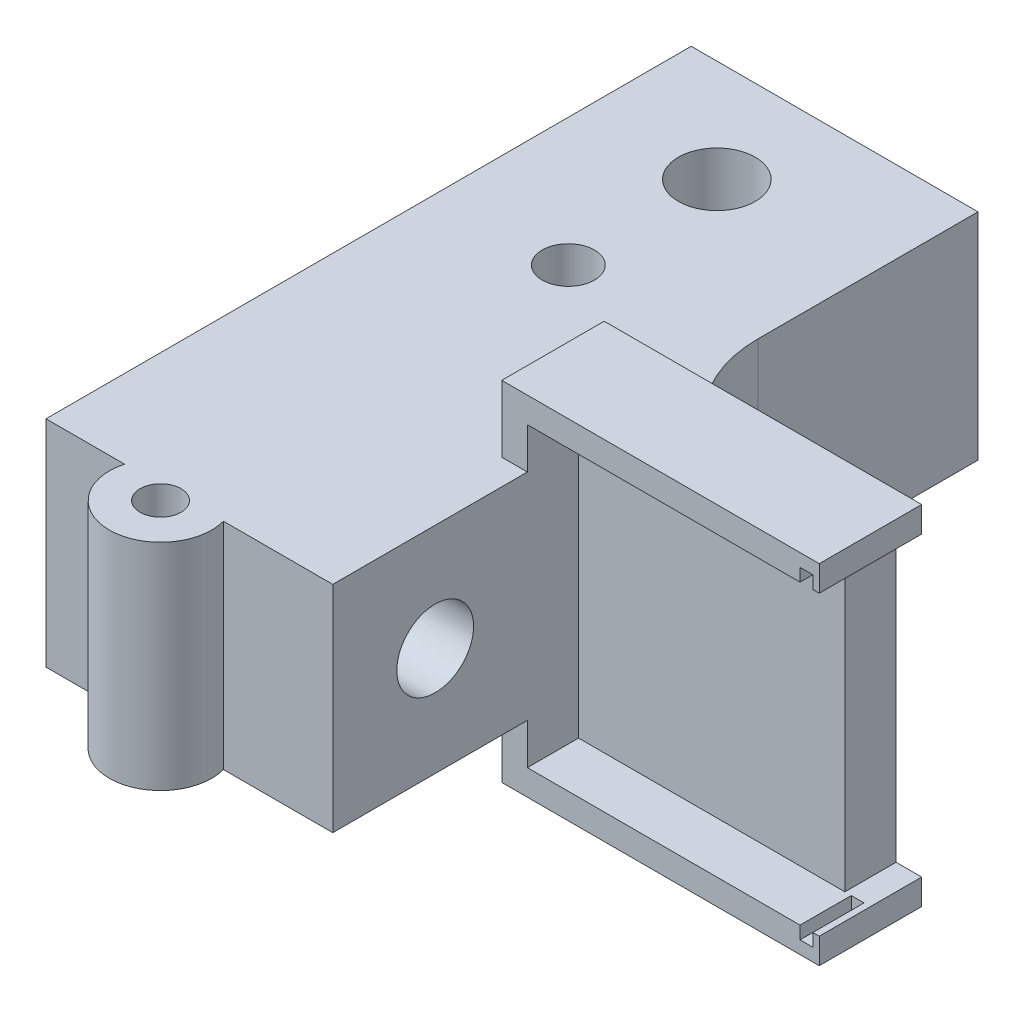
ISO-10303-21;
HEADER;
FILE_DESCRIPTION(('STEP AP214'),'2;1');
FILE_NAME('part.step','',(''),(''),'','','');
FILE_SCHEMA(('AUTOMOTIVE_DESIGN { 1 0 10303 214 1 1 1 1 }'));
ENDSEC;
DATA;
#1=APPLICATION_CONTEXT('core data for automotive mechanical design processes');
#2=APPLICATION_PROTOCOL_DEFINITION('international standard','automotive_design',2000,#1);
#3=PRODUCT_CONTEXT('',#1,'mechanical');
#4=PRODUCT('Part','Part','',(#3));
#5=PRODUCT_RELATED_PRODUCT_CATEGORY('part','',(#4));
#6=PRODUCT_DEFINITION_FORMATION('','',#4);
#7=PRODUCT_DEFINITION_CONTEXT('part definition',#1,'design');
#8=PRODUCT_DEFINITION('design','',#6,#7);
#9=PRODUCT_DEFINITION_SHAPE('','',#8);
#10=(LENGTH_UNIT() NAMED_UNIT(*) SI_UNIT(.MILLI.,.METRE.));
#11=(NAMED_UNIT(*) PLANE_ANGLE_UNIT() SI_UNIT($,.RADIAN.));
#12=(NAMED_UNIT(*) SI_UNIT($,.STERADIAN.) SOLID_ANGLE_UNIT());
#13=UNCERTAINTY_MEASURE_WITH_UNIT(LENGTH_MEASURE(1.E-05),#10,'distance_accuracy_value','');
#14=(GEOMETRIC_REPRESENTATION_CONTEXT(3) GLOBAL_UNCERTAINTY_ASSIGNED_CONTEXT((#13)) GLOBAL_UNIT_ASSIGNED_CONTEXT((#10,
#11,#12)) REPRESENTATION_CONTEXT('',''));
#15=CARTESIAN_POINT('',(0.,0.,0.));
#16=DIRECTION('',(0.,0.,1.));
#17=DIRECTION('',(1.,0.,0.));
#18=AXIS2_PLACEMENT_3D('',#15,#16,#17);
#19=CARTESIAN_POINT('',(597.617923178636,21.172874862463,26.4801788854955));
#20=DIRECTION('',(-1.,0.,0.));
#21=DIRECTION('',(0.,0.,1.));
#22=AXIS2_PLACEMENT_3D('',#19,#20,#21);
#23=CYLINDRICAL_SURFACE('',#22,4.);
#24=CARTESIAN_POINT('',(530.304214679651,21.172874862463,26.4801788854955));
#25=DIRECTION('',(-1.,0.,0.));
#26=DIRECTION('',(0.,0.,1.));
#27=AXIS2_PLACEMENT_3D('',#24,#25,#26);
#28=CIRCLE('',#27,4.);
#29=CARTESIAN_POINT('',(530.304214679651,21.172874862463,30.4801788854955));
#30=VERTEX_POINT('',#29);
#31=EDGE_CURVE('E464',#30,#30,#28,.T.);
#32=ORIENTED_EDGE('',*,*,#31,.T.);
#33=EDGE_LOOP('',(#32));
#34=FACE_BOUND('',#33,.T.);
#35=CARTESIAN_POINT('',(561.304214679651,21.172874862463,26.4801788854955));
#36=DIRECTION('',(1.,0.,0.));
#37=DIRECTION('',(0.,0.,-1.));
#38=AXIS2_PLACEMENT_3D('',#35,#36,#37);
#39=CIRCLE('',#38,4.);
#40=CARTESIAN_POINT('',(561.304214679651,21.172874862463,22.4801788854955));
#41=VERTEX_POINT('',#40);
#42=EDGE_CURVE('E285',#41,#41,#39,.F.);
#43=ORIENTED_EDGE('',*,*,#42,.F.);
#44=EDGE_LOOP('',(#43));
#45=FACE_BOUND('',#44,.T.);
#46=ADVANCED_FACE('F64',(#34,#45),#23,.F.);
#47=CARTESIAN_POINT('',(555.304214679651,42.,-59.5198211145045));
#48=DIRECTION('',(0.,-1.,0.));
#49=DIRECTION('',(0.,0.,-1.));
#50=AXIS2_PLACEMENT_3D('',#47,#48,#49);
#51=CYLINDRICAL_SURFACE('',#50,3.99999999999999);
#52=CARTESIAN_POINT('',(555.304214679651,0.,-59.5198211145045));
#53=DIRECTION('',(0.,1.,0.));
#54=DIRECTION('',(0.,0.,1.));
#55=AXIS2_PLACEMENT_3D('',#52,#53,#54);
#56=CIRCLE('',#55,3.99999999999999);
#57=CARTESIAN_POINT('',(555.304214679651,0.,-63.5198211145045));
#58=VERTEX_POINT('',#57);
#59=EDGE_CURVE('E576',#58,#58,#56,.T.);
#60=CARTESIAN_POINT('',(555.304214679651,14.,-59.5198211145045));
#61=DIRECTION('',(0.,1.,0.));
#62=DIRECTION('',(0.,0.,1.));
#63=AXIS2_PLACEMENT_3D('',#60,#61,#62);
#64=CIRCLE('',#63,3.99999999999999);
#65=CARTESIAN_POINT('',(555.304214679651,14.,-63.5198211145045));
#66=VERTEX_POINT('',#65);
#67=EDGE_CURVE('E293',#66,#66,#64,.T.);
#68=CARTESIAN_POINT('',(555.304214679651,0.,-63.5198211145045));
#69=CARTESIAN_POINT('',(555.304214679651,0.145833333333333,-63.5198211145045));
#70=CARTESIAN_POINT('',(555.304214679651,0.291666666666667,-63.5198211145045));
#71=CARTESIAN_POINT('',(555.304214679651,0.583333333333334,-63.5198211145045));
#72=CARTESIAN_POINT('',(555.304214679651,0.729166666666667,-63.5198211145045));
#73=CARTESIAN_POINT('',(555.304214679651,1.02083333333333,-63.5198211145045));
#74=CARTESIAN_POINT('',(555.304214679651,1.16666666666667,-63.5198211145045));
#75=CARTESIAN_POINT('',(555.304214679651,1.45833333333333,-63.5198211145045));
#76=CARTESIAN_POINT('',(555.304214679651,1.60416666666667,-63.5198211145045));
#77=CARTESIAN_POINT('',(555.304214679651,1.89583333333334,-63.5198211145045));
#78=CARTESIAN_POINT('',(555.304214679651,2.04166666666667,-63.5198211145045));
#79=CARTESIAN_POINT('',(555.304214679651,2.33333333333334,-63.5198211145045));
#80=CARTESIAN_POINT('',(555.304214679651,2.47916666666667,-63.5198211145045));
#81=CARTESIAN_POINT('',(555.304214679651,2.77083333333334,-63.5198211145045));
#82=CARTESIAN_POINT('',(555.304214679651,2.91666666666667,-63.5198211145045));
#83=CARTESIAN_POINT('',(555.304214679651,3.20833333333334,-63.5198211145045));
#84=CARTESIAN_POINT('',(555.304214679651,3.35416666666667,-63.5198211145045));
#85=CARTESIAN_POINT('',(555.304214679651,3.64583333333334,-63.5198211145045));
#86=CARTESIAN_POINT('',(555.304214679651,3.79166666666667,-63.5198211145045));
#87=CARTESIAN_POINT('',(555.304214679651,4.08333333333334,-63.5198211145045));
#88=CARTESIAN_POINT('',(555.304214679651,4.22916666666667,-63.5198211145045));
#89=CARTESIAN_POINT('',(555.304214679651,4.52083333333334,-63.5198211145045));
#90=CARTESIAN_POINT('',(555.304214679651,4.66666666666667,-63.5198211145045));
#91=CARTESIAN_POINT('',(555.304214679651,4.95833333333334,-63.5198211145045));
#92=CARTESIAN_POINT('',(555.304214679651,5.10416666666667,-63.5198211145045));
#93=CARTESIAN_POINT('',(555.304214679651,5.39583333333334,-63.5198211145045));
#94=CARTESIAN_POINT('',(555.304214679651,5.54166666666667,-63.5198211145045));
#95=CARTESIAN_POINT('',(555.304214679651,5.83333333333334,-63.5198211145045));
#96=CARTESIAN_POINT('',(555.304214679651,5.97916666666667,-63.5198211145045));
#97=CARTESIAN_POINT('',(555.304214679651,6.27083333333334,-63.5198211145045));
#98=CARTESIAN_POINT('',(555.304214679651,6.41666666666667,-63.5198211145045));
#99=CARTESIAN_POINT('',(555.304214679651,6.70833333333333,-63.5198211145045));
#100=CARTESIAN_POINT('',(555.304214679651,6.85416666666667,-63.5198211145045));
#101=CARTESIAN_POINT('',(555.304214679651,7.14583333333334,-63.5198211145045));
#102=CARTESIAN_POINT('',(555.304214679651,7.29166666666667,-63.5198211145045));
#103=CARTESIAN_POINT('',(555.304214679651,7.58333333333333,-63.5198211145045));
#104=CARTESIAN_POINT('',(555.304214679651,7.72916666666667,-63.5198211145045));
#105=CARTESIAN_POINT('',(555.304214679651,8.02083333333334,-63.5198211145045));
#106=CARTESIAN_POINT('',(555.304214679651,8.16666666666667,-63.5198211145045));
#107=CARTESIAN_POINT('',(555.304214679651,8.45833333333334,-63.5198211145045));
#108=CARTESIAN_POINT('',(555.304214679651,8.60416666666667,-63.5198211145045));
#109=CARTESIAN_POINT('',(555.304214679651,8.89583333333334,-63.5198211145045));
#110=CARTESIAN_POINT('',(555.304214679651,9.04166666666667,-63.5198211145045));
#111=CARTESIAN_POINT('',(555.304214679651,9.33333333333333,-63.5198211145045));
#112=CARTESIAN_POINT('',(555.304214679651,9.47916666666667,-63.5198211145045));
#113=CARTESIAN_POINT('',(555.304214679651,9.77083333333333,-63.5198211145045));
#114=CARTESIAN_POINT('',(555.304214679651,9.91666666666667,-63.5198211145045));
#115=CARTESIAN_POINT('',(555.304214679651,10.2083333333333,-63.5198211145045));
#116=CARTESIAN_POINT('',(555.304214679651,10.3541666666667,-63.5198211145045));
#117=CARTESIAN_POINT('',(555.304214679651,10.6458333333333,-63.5198211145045));
#118=CARTESIAN_POINT('',(555.304214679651,10.7916666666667,-63.5198211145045));
#119=CARTESIAN_POINT('',(555.304214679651,11.0833333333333,-63.5198211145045));
#120=CARTESIAN_POINT('',(555.304214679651,11.2291666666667,-63.5198211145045));
#121=CARTESIAN_POINT('',(555.304214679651,11.5208333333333,-63.5198211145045));
#122=CARTESIAN_POINT('',(555.304214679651,11.6666666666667,-63.5198211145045));
#123=CARTESIAN_POINT('',(555.304214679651,11.9583333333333,-63.5198211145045));
#124=CARTESIAN_POINT('',(555.304214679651,12.1041666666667,-63.5198211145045));
#125=CARTESIAN_POINT('',(555.304214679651,12.3958333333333,-63.5198211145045));
#126=CARTESIAN_POINT('',(555.304214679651,12.5416666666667,-63.5198211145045));
#127=CARTESIAN_POINT('',(555.304214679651,12.8333333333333,-63.5198211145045));
#128=CARTESIAN_POINT('',(555.304214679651,12.9791666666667,-63.5198211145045));
#129=CARTESIAN_POINT('',(555.304214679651,13.2708333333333,-63.5198211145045));
#130=CARTESIAN_POINT('',(555.304214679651,13.4166666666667,-63.5198211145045));
#131=CARTESIAN_POINT('',(555.304214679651,13.7083333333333,-63.5198211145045));
#132=CARTESIAN_POINT('',(555.304214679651,13.8541666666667,-63.5198211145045));
#133=CARTESIAN_POINT('',(555.304214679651,14.,-63.5198211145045));
#134=B_SPLINE_CURVE_WITH_KNOTS('',3,(#68,#69,#70,#71,#72,#73,#74,#75,#76,#77,#78,#79,#80,#81,
#82,#83,#84,#85,#86,#87,#88,#89,#90,#91,#92,#93,#94,#95,#96,#97,#98,#99,#100,#101,#102,#103,
#104,#105,#106,#107,#108,#109,#110,#111,#112,#113,#114,#115,#116,#117,#118,#119,#120,#121,#122,
#123,#124,#125,#126,#127,#128,#129,#130,#131,#132,#133),.UNSPECIFIED.,.F.,.F.,(4,2,2,2,2,2,2,2,
2,2,2,2,2,2,2,2,2,2,2,2,2,2,2,2,2,2,2,2,2,2,2,2,4),(0.,0.4375,0.875000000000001,1.3125,1.75,
2.1875,2.625,3.0625,3.5,3.9375,4.375,4.8125,5.25,5.68750000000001,6.12500000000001,6.5625,
7.00000000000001,7.4375,7.87500000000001,8.3125,8.75000000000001,9.1875,9.625,10.0625,10.5,
10.9375,11.375,11.8125,12.25,12.6875,13.125,13.5625,14.),.UNSPECIFIED.);
#135=EDGE_CURVE('BSEAM654',#58,#66,#134,.T.);
#136=ORIENTED_EDGE('',*,*,#59,.F.);
#137=ORIENTED_EDGE('',*,*,#67,.T.);
#138=ORIENTED_EDGE('',*,*,#135,.T.);
#139=ORIENTED_EDGE('',*,*,#135,.F.);
#140=EDGE_LOOP('',(#136,#138,#137,#139));
#141=FACE_BOUND('',#140,.T.);
#142=ADVANCED_FACE('F654',(#141),#51,.F.);
#143=CARTESIAN_POINT('',(0.,42.,0.));
#144=DIRECTION('',(0.,1.,0.));
#145=DIRECTION('',(0.,0.,1.));
#146=AXIS2_PLACEMENT_3D('',#143,#144,#145);
#147=PLANE('',#146);
#148=DIRECTION('',(-1.,0.,0.));
#149=VECTOR('',#148,1.);
#150=CARTESIAN_POINT('',(0.,42.,46.4801788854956));
#151=LINE('',#150,#149);
#152=CARTESIAN_POINT('',(545.656256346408,42.,46.4801788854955));
#153=VERTEX_POINT('',#152);
#154=CARTESIAN_POINT('',(530.304214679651,42.,46.4801788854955));
#155=VERTEX_POINT('',#154);
#156=EDGE_CURVE('E256',#153,#155,#151,.T.);
#157=ORIENTED_EDGE('',*,*,#156,.F.);
#158=CARTESIAN_POINT('',(555.304214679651,42.,49.1101788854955));
#159=DIRECTION('',(0.,1.,0.));
#160=DIRECTION('',(0.,0.,1.));
#161=AXIS2_PLACEMENT_3D('',#158,#159,#160);
#162=CIRCLE('',#161,9.99999999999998);
#163=CARTESIAN_POINT('',(564.952173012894,42.,46.4801788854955));
#164=VERTEX_POINT('',#163);
#165=EDGE_CURVE('E260',#164,#153,#162,.F.);
#166=ORIENTED_EDGE('',*,*,#165,.F.);
#167=CARTESIAN_POINT('',(586.304214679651,42.,46.4801788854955));
#168=VERTEX_POINT('',#167);
#169=EDGE_CURVE('E88',#168,#164,#151,.T.);
#170=ORIENTED_EDGE('',*,*,#169,.F.);
#171=DIRECTION('',(0.,0.,-1.));
#172=VECTOR('',#171,1.);
#173=CARTESIAN_POINT('',(586.304214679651,42.,0.));
#174=LINE('',#173,#172);
#175=CARTESIAN_POINT('',(586.304214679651,42.,8.48017888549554));
#176=VERTEX_POINT('',#175);
#177=EDGE_CURVE('E582',#168,#176,#174,.T.);
#178=ORIENTED_EDGE('',*,*,#177,.T.);
#179=DIRECTION('',(1.,0.,0.));
#180=VECTOR('',#179,1.);
#181=CARTESIAN_POINT('',(0.,42.,8.48017888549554));
#182=LINE('',#181,#180);
#183=CARTESIAN_POINT('',(581.304214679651,42.,8.48017888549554));
#184=VERTEX_POINT('',#183);
#185=EDGE_CURVE('E345',#184,#176,#182,.T.);
#186=ORIENTED_EDGE('',*,*,#185,.F.);
#187=DIRECTION('',(0.,0.,1.));
#188=VECTOR('',#187,1.);
#189=CARTESIAN_POINT('',(581.304214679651,42.,-11.5198211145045));
#190=LINE('',#189,#188);
#191=CARTESIAN_POINT('',(581.304214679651,42.,-11.5198211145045));
#192=VERTEX_POINT('',#191);
#193=EDGE_CURVE('E394',#192,#184,#190,.T.);
#194=ORIENTED_EDGE('',*,*,#193,.F.);
#195=DIRECTION('',(-1.,0.,0.));
#196=VECTOR('',#195,1.);
#197=CARTESIAN_POINT('',(0.,42.,-11.5198211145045));
#198=LINE('',#197,#196);
#199=CARTESIAN_POINT('',(611.304214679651,42.,-11.5198211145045));
#200=VERTEX_POINT('',#199);
#201=EDGE_CURVE('E629',#200,#192,#198,.T.);
#202=ORIENTED_EDGE('',*,*,#201,.F.);
#203=CARTESIAN_POINT('',(611.304214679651,42.,-36.5198211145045));
#204=DIRECTION('',(0.,1.,0.));
#205=DIRECTION('',(0.,0.,1.));
#206=AXIS2_PLACEMENT_3D('',#203,#204,#205);
#207=CIRCLE('',#206,25.);
#208=CARTESIAN_POINT('',(586.304214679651,42.,-36.5198211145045));
#209=VERTEX_POINT('',#208);
#210=EDGE_CURVE('E73',#200,#209,#207,.F.);
#211=ORIENTED_EDGE('',*,*,#210,.T.);
#212=CARTESIAN_POINT('',(586.304214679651,42.,-79.5198211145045));
#213=VERTEX_POINT('',#212);
#214=EDGE_CURVE('E581',#209,#213,#174,.T.);
#215=ORIENTED_EDGE('',*,*,#214,.T.);
#216=DIRECTION('',(-1.,0.,0.));
#217=VECTOR('',#216,1.);
#218=CARTESIAN_POINT('',(0.,42.,-79.5198211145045));
#219=LINE('',#218,#217);
#220=CARTESIAN_POINT('',(530.304214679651,42.,-79.5198211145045));
#221=VERTEX_POINT('',#220);
#222=EDGE_CURVE('E585',#213,#221,#219,.T.);
#223=ORIENTED_EDGE('',*,*,#222,.T.);
#224=DIRECTION('',(0.,0.,-1.));
#225=VECTOR('',#224,1.);
#226=CARTESIAN_POINT('',(530.304214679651,42.,0.));
#227=LINE('',#226,#225);
#228=EDGE_CURVE('E262',#155,#221,#227,.T.);
#229=ORIENTED_EDGE('',*,*,#228,.F.);
#230=EDGE_LOOP('',(#157,#166,#170,#178,#186,#194,#202,#211,#215,#223,#229));
#231=FACE_BOUND('',#230,.T.);
#232=CARTESIAN_POINT('',(555.304214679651,42.,-59.5198211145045));
#233=DIRECTION('',(0.,1.,0.));
#234=DIRECTION('',(0.,0.,1.));
#235=AXIS2_PLACEMENT_3D('',#232,#233,#234);
#236=CIRCLE('',#235,7.49999999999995);
#237=CARTESIAN_POINT('',(555.304214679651,42.,-52.0198211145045));
#238=VERTEX_POINT('',#237);
#239=EDGE_CURVE('E294',#238,#238,#236,.T.);
#240=ORIENTED_EDGE('',*,*,#239,.F.);
#241=EDGE_LOOP('',(#240));
#242=FACE_BOUND('',#241,.T.);
#243=CARTESIAN_POINT('',(555.304214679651,42.,-30.5198211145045));
#244=DIRECTION('',(0.,1.,0.));
#245=DIRECTION('',(0.,0.,1.));
#246=AXIS2_PLACEMENT_3D('',#243,#244,#245);
#247=CIRCLE('',#246,5.09999999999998);
#248=CARTESIAN_POINT('',(555.304214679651,42.,-35.6198211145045));
#249=VERTEX_POINT('',#248);
#250=EDGE_CURVE('E528',#249,#249,#247,.T.);
#251=ORIENTED_EDGE('',*,*,#250,.F.);
#252=EDGE_LOOP('',(#251));
#253=FACE_BOUND('',#252,.T.);
#254=CARTESIAN_POINT('',(555.304214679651,42.,49.1101788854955));
#255=DIRECTION('',(0.,-1.,0.));
#256=DIRECTION('',(0.,0.,-1.));
#257=AXIS2_PLACEMENT_3D('',#254,#255,#256);
#258=CIRCLE('',#257,3.99999999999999);
#259=CARTESIAN_POINT('',(555.304214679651,42.,45.1101788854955));
#260=VERTEX_POINT('',#259);
#261=EDGE_CURVE('E516',#260,#260,#258,.T.);
#262=ORIENTED_EDGE('',*,*,#261,.T.);
#263=EDGE_LOOP('',(#262));
#264=FACE_BOUND('',#263,.T.);
#265=ADVANCED_FACE('F257',(#231,#242,#253,#264),#147,.T.);
#266=CARTESIAN_POINT('',(0.,0.,0.));
#267=DIRECTION('',(0.,1.,0.));
#268=DIRECTION('',(0.,0.,1.));
#269=AXIS2_PLACEMENT_3D('',#266,#267,#268);
#270=PLANE('',#269);
#271=ORIENTED_EDGE('',*,*,#59,.T.);
#272=EDGE_LOOP('',(#271));
#273=FACE_BOUND('',#272,.T.);
#274=CARTESIAN_POINT('',(555.304214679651,0.,-30.5198211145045));
#275=DIRECTION('',(0.,-1.,0.));
#276=DIRECTION('',(0.,0.,-1.));
#277=AXIS2_PLACEMENT_3D('',#274,#275,#276);
#278=CIRCLE('',#277,11.);
#279=CARTESIAN_POINT('',(555.304214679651,0.,-41.5198211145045));
#280=VERTEX_POINT('',#279);
#281=EDGE_CURVE('E565',#280,#280,#278,.T.);
#282=ORIENTED_EDGE('',*,*,#281,.F.);
#283=EDGE_LOOP('',(#282));
#284=FACE_BOUND('',#283,.T.);
#285=DIRECTION('',(-1.,0.,0.));
#286=VECTOR('',#285,1.);
#287=CARTESIAN_POINT('',(0.,0.,46.4801788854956));
#288=LINE('',#287,#286);
#289=CARTESIAN_POINT('',(586.304214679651,0.,46.4801788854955));
#290=VERTEX_POINT('',#289);
#291=CARTESIAN_POINT('',(564.952173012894,0.,46.4801788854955));
#292=VERTEX_POINT('',#291);
#293=EDGE_CURVE('E596',#290,#292,#288,.T.);
#294=ORIENTED_EDGE('',*,*,#293,.T.);
#295=CARTESIAN_POINT('',(555.304214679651,0.,49.1101788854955));
#296=DIRECTION('',(0.,-1.,0.));
#297=DIRECTION('',(0.,0.,-1.));
#298=AXIS2_PLACEMENT_3D('',#295,#296,#297);
#299=CIRCLE('',#298,9.99999999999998);
#300=CARTESIAN_POINT('',(545.656256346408,0.,46.4801788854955));
#301=VERTEX_POINT('',#300);
#302=EDGE_CURVE('E273',#292,#301,#299,.T.);
#303=ORIENTED_EDGE('',*,*,#302,.T.);
#304=CARTESIAN_POINT('',(530.304214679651,0.,46.4801788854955));
#305=VERTEX_POINT('',#304);
#306=EDGE_CURVE('E80',#301,#305,#288,.T.);
#307=ORIENTED_EDGE('',*,*,#306,.T.);
#308=DIRECTION('',(0.,0.,-1.));
#309=VECTOR('',#308,1.);
#310=CARTESIAN_POINT('',(530.304214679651,0.,0.));
#311=LINE('',#310,#309);
#312=CARTESIAN_POINT('',(530.304214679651,0.,-79.5198211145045));
#313=VERTEX_POINT('',#312);
#314=EDGE_CURVE('E592',#305,#313,#311,.T.);
#315=ORIENTED_EDGE('',*,*,#314,.T.);
#316=DIRECTION('',(-1.,0.,0.));
#317=VECTOR('',#316,1.);
#318=CARTESIAN_POINT('',(0.,0.,-79.5198211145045));
#319=LINE('',#318,#317);
#320=CARTESIAN_POINT('',(586.304214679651,0.,-79.5198211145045));
#321=VERTEX_POINT('',#320);
#322=EDGE_CURVE('E578',#321,#313,#319,.T.);
#323=ORIENTED_EDGE('',*,*,#322,.F.);
#324=DIRECTION('',(0.,0.,-1.));
#325=VECTOR('',#324,1.);
#326=CARTESIAN_POINT('',(586.304214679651,0.,0.));
#327=LINE('',#326,#325);
#328=CARTESIAN_POINT('',(586.304214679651,0.,-36.5198211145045));
#329=VERTEX_POINT('',#328);
#330=EDGE_CURVE('E600',#329,#321,#327,.T.);
#331=ORIENTED_EDGE('',*,*,#330,.F.);
#332=CARTESIAN_POINT('',(611.304214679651,0.,-36.5198211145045));
#333=DIRECTION('',(0.,1.,0.));
#334=DIRECTION('',(0.,0.,1.));
#335=AXIS2_PLACEMENT_3D('',#332,#333,#334);
#336=CIRCLE('',#335,25.);
#337=CARTESIAN_POINT('',(611.304214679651,0.,-11.5198211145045));
#338=VERTEX_POINT('',#337);
#339=EDGE_CURVE('E640',#329,#338,#336,.T.);
#340=ORIENTED_EDGE('',*,*,#339,.T.);
#341=DIRECTION('',(1.,0.,0.));
#342=VECTOR('',#341,1.);
#343=CARTESIAN_POINT('',(638.304214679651,0.,-11.5198211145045));
#344=LINE('',#343,#342);
#345=CARTESIAN_POINT('',(581.304214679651,0.,-11.5198211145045));
#346=VERTEX_POINT('',#345);
#347=EDGE_CURVE('E636',#346,#338,#344,.T.);
#348=ORIENTED_EDGE('',*,*,#347,.F.);
#349=DIRECTION('',(0.,0.,1.));
#350=VECTOR('',#349,1.);
#351=CARTESIAN_POINT('',(581.304214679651,0.,-11.5198211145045));
#352=LINE('',#351,#350);
#353=CARTESIAN_POINT('',(581.304214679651,0.,8.48017888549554));
#354=VERTEX_POINT('',#353);
#355=EDGE_CURVE('E465',#346,#354,#352,.T.);
#356=ORIENTED_EDGE('',*,*,#355,.T.);
#357=DIRECTION('',(1.,0.,0.));
#358=VECTOR('',#357,1.);
#359=CARTESIAN_POINT('',(0.,0.,8.48017888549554));
#360=LINE('',#359,#358);
#361=CARTESIAN_POINT('',(586.304214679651,0.,8.48017888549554));
#362=VERTEX_POINT('',#361);
#363=EDGE_CURVE('E437',#354,#362,#360,.T.);
#364=ORIENTED_EDGE('',*,*,#363,.T.);
#365=EDGE_CURVE('E601',#290,#362,#327,.T.);
#366=ORIENTED_EDGE('',*,*,#365,.F.);
#367=EDGE_LOOP('',(#294,#303,#307,#315,#323,#331,#340,#348,#356,#364,#366));
#368=FACE_BOUND('',#367,.T.);
#369=CARTESIAN_POINT('',(555.304214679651,0.,49.1101788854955));
#370=DIRECTION('',(0.,1.,0.));
#371=DIRECTION('',(0.,0.,1.));
#372=AXIS2_PLACEMENT_3D('',#369,#370,#371);
#373=CIRCLE('',#372,3.99999999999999);
#374=CARTESIAN_POINT('',(555.304214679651,0.,45.1101788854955));
#375=VERTEX_POINT('',#374);
#376=EDGE_CURVE('E511',#375,#375,#373,.T.);
#377=ORIENTED_EDGE('',*,*,#376,.T.);
#378=EDGE_LOOP('',(#377));
#379=FACE_BOUND('',#378,.T.);
#380=ADVANCED_FACE('F736',(#273,#284,#368,#379),#270,.F.);
#381=CARTESIAN_POINT('',(586.304214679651,42.,0.));
#382=DIRECTION('',(-1.,0.,0.));
#383=DIRECTION('',(0.,0.,1.));
#384=AXIS2_PLACEMENT_3D('',#381,#382,#383);
#385=PLANE('',#384);
#386=ORIENTED_EDGE('',*,*,#214,.F.);
#387=DIRECTION('',(0.,-1.,0.));
#388=VECTOR('',#387,1.);
#389=CARTESIAN_POINT('',(586.304214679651,42.,-36.5198211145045));
#390=LINE('',#389,#388);
#391=EDGE_CURVE('E510',#209,#329,#390,.T.);
#392=ORIENTED_EDGE('',*,*,#391,.T.);
#393=ORIENTED_EDGE('',*,*,#330,.T.);
#394=DIRECTION('',(0.,-1.,0.));
#395=VECTOR('',#394,1.);
#396=CARTESIAN_POINT('',(586.304214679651,42.,-79.5198211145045));
#397=LINE('',#396,#395);
#398=EDGE_CURVE('E610',#213,#321,#397,.T.);
#399=ORIENTED_EDGE('',*,*,#398,.F.);
#400=EDGE_LOOP('',(#386,#392,#393,#399));
#401=FACE_BOUND('',#400,.T.);
#402=ADVANCED_FACE('F739',(#401),#385,.F.);
#403=CARTESIAN_POINT('',(0.,42.,46.4801788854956));
#404=DIRECTION('',(0.,0.,1.));
#405=DIRECTION('',(1.,0.,0.));
#406=AXIS2_PLACEMENT_3D('',#403,#404,#405);
#407=PLANE('',#406);
#408=DIRECTION('',(0.,-1.,0.));
#409=VECTOR('',#408,1.);
#410=CARTESIAN_POINT('',(545.656256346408,70.2842712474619,46.4801788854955));
#411=LINE('',#410,#409);
#412=EDGE_CURVE('E266',#153,#301,#411,.T.);
#413=ORIENTED_EDGE('',*,*,#412,.F.);
#414=ORIENTED_EDGE('',*,*,#156,.T.);
#415=DIRECTION('',(0.,-1.,0.));
#416=VECTOR('',#415,1.);
#417=CARTESIAN_POINT('',(530.304214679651,42.,46.4801788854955));
#418=LINE('',#417,#416);
#419=EDGE_CURVE('E617',#155,#305,#418,.T.);
#420=ORIENTED_EDGE('',*,*,#419,.T.);
#421=ORIENTED_EDGE('',*,*,#306,.F.);
#422=EDGE_LOOP('',(#413,#414,#420,#421));
#423=FACE_BOUND('',#422,.T.);
#424=ADVANCED_FACE('F267',(#423),#407,.T.);
#425=CARTESIAN_POINT('',(530.304214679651,42.,0.));
#426=DIRECTION('',(-1.,0.,0.));
#427=DIRECTION('',(0.,0.,1.));
#428=AXIS2_PLACEMENT_3D('',#425,#426,#427);
#429=PLANE('',#428);
#430=ORIENTED_EDGE('',*,*,#31,.F.);
#431=EDGE_LOOP('',(#430));
#432=FACE_BOUND('',#431,.T.);
#433=CARTESIAN_POINT('',(530.304214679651,21.172874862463,-1.51982111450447));
#434=DIRECTION('',(-1.,0.,0.));
#435=DIRECTION('',(0.,0.,1.));
#436=AXIS2_PLACEMENT_3D('',#433,#434,#435);
#437=CIRCLE('',#436,4.);
#438=CARTESIAN_POINT('',(530.304214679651,21.172874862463,2.48017888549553));
#439=VERTEX_POINT('',#438);
#440=EDGE_CURVE('E564',#439,#439,#437,.T.);
#441=ORIENTED_EDGE('',*,*,#440,.F.);
#442=EDGE_LOOP('',(#441));
#443=FACE_BOUND('',#442,.T.);
#444=ORIENTED_EDGE('',*,*,#314,.F.);
#445=ORIENTED_EDGE('',*,*,#419,.F.);
#446=ORIENTED_EDGE('',*,*,#228,.T.);
#447=DIRECTION('',(0.,-1.,0.));
#448=VECTOR('',#447,1.);
#449=CARTESIAN_POINT('',(530.304214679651,42.,-79.5198211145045));
#450=LINE('',#449,#448);
#451=EDGE_CURVE('E588',#221,#313,#450,.T.);
#452=ORIENTED_EDGE('',*,*,#451,.T.);
#453=EDGE_LOOP('',(#444,#445,#446,#452));
#454=FACE_BOUND('',#453,.T.);
#455=ADVANCED_FACE('F751',(#432,#443,#454),#429,.T.);
#456=DIRECTION('',(0.,-1.,0.));
#457=VECTOR('',#456,1.);
#458=CARTESIAN_POINT('',(564.952173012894,70.2842712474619,46.4801788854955));
#459=LINE('',#458,#457);
#460=EDGE_CURVE('E13',#292,#164,#459,.F.);
#461=ORIENTED_EDGE('',*,*,#460,.F.);
#462=ORIENTED_EDGE('',*,*,#293,.F.);
#463=DIRECTION('',(0.,-1.,0.));
#464=VECTOR('',#463,1.);
#465=CARTESIAN_POINT('',(586.304214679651,42.,46.4801788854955));
#466=LINE('',#465,#464);
#467=EDGE_CURVE('E614',#168,#290,#466,.T.);
#468=ORIENTED_EDGE('',*,*,#467,.F.);
#469=ORIENTED_EDGE('',*,*,#169,.T.);
#470=EDGE_LOOP('',(#461,#462,#468,#469));
#471=FACE_BOUND('',#470,.T.);
#472=ADVANCED_FACE('F747',(#471),#407,.T.);
#473=CARTESIAN_POINT('',(586.304214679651,21.172874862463,26.4801788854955));
#474=DIRECTION('',(1.,0.,0.));
#475=DIRECTION('',(0.,0.,-1.));
#476=AXIS2_PLACEMENT_3D('',#473,#474,#475);
#477=CIRCLE('',#476,7.5);
#478=CARTESIAN_POINT('',(586.304214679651,21.172874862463,18.9801788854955));
#479=VERTEX_POINT('',#478);
#480=EDGE_CURVE('E272',#479,#479,#477,.T.);
#481=ORIENTED_EDGE('',*,*,#480,.F.);
#482=EDGE_LOOP('',(#481));
#483=FACE_BOUND('',#482,.T.);
#484=ORIENTED_EDGE('',*,*,#365,.T.);
#485=DIRECTION('',(0.,-1.,0.));
#486=VECTOR('',#485,1.);
#487=CARTESIAN_POINT('',(586.304214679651,0.,8.48017888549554));
#488=LINE('',#487,#486);
#489=CARTESIAN_POINT('',(586.304214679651,-8.00000000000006,8.48017888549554));
#490=VERTEX_POINT('',#489);
#491=EDGE_CURVE('E433',#362,#490,#488,.T.);
#492=ORIENTED_EDGE('',*,*,#491,.T.);
#493=DIRECTION('',(0.,0.,1.));
#494=VECTOR('',#493,1.);
#495=CARTESIAN_POINT('',(586.304214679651,-8.00000000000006,-11.5198211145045));
#496=LINE('',#495,#494);
#497=CARTESIAN_POINT('',(586.304214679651,-8.00000000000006,-1.51982111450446));
#498=VERTEX_POINT('',#497);
#499=EDGE_CURVE('E468',#498,#490,#496,.T.);
#500=ORIENTED_EDGE('',*,*,#499,.F.);
#501=DIRECTION('',(0.,1.,0.));
#502=VECTOR('',#501,1.);
#503=CARTESIAN_POINT('',(586.304214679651,42.,-1.51982111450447));
#504=LINE('',#503,#502);
#505=CARTESIAN_POINT('',(586.304214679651,50.,-1.51982111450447));
#506=VERTEX_POINT('',#505);
#507=EDGE_CURVE('E507',#498,#506,#504,.T.);
#508=ORIENTED_EDGE('',*,*,#507,.T.);
#509=DIRECTION('',(0.,0.,1.));
#510=VECTOR('',#509,1.);
#511=CARTESIAN_POINT('',(586.304214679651,50.,-11.5198211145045));
#512=LINE('',#511,#510);
#513=CARTESIAN_POINT('',(586.304214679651,50.,8.48017888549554));
#514=VERTEX_POINT('',#513);
#515=EDGE_CURVE('E391',#506,#514,#512,.T.);
#516=ORIENTED_EDGE('',*,*,#515,.T.);
#517=DIRECTION('',(0.,-1.,0.));
#518=VECTOR('',#517,1.);
#519=CARTESIAN_POINT('',(586.304214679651,0.,8.48017888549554));
#520=LINE('',#519,#518);
#521=EDGE_CURVE('E349',#514,#176,#520,.T.);
#522=ORIENTED_EDGE('',*,*,#521,.T.);
#523=ORIENTED_EDGE('',*,*,#177,.F.);
#524=ORIENTED_EDGE('',*,*,#467,.T.);
#525=EDGE_LOOP('',(#484,#492,#500,#508,#516,#522,#523,#524));
#526=FACE_BOUND('',#525,.T.);
#527=ADVANCED_FACE('F743',(#483,#526),#385,.F.);
#528=CARTESIAN_POINT('',(0.,42.,-79.5198211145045));
#529=DIRECTION('',(0.,0.,1.));
#530=DIRECTION('',(1.,0.,0.));
#531=AXIS2_PLACEMENT_3D('',#528,#529,#530);
#532=PLANE('',#531);
#533=ORIENTED_EDGE('',*,*,#322,.T.);
#534=ORIENTED_EDGE('',*,*,#451,.F.);
#535=ORIENTED_EDGE('',*,*,#222,.F.);
#536=ORIENTED_EDGE('',*,*,#398,.T.);
#537=EDGE_LOOP('',(#533,#534,#535,#536));
#538=FACE_BOUND('',#537,.T.);
#539=ADVANCED_FACE('F732',(#538),#532,.F.);
#540=CARTESIAN_POINT('',(597.617923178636,21.172874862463,-1.51982111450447));
#541=DIRECTION('',(-1.,0.,0.));
#542=DIRECTION('',(0.,0.,1.));
#543=AXIS2_PLACEMENT_3D('',#540,#541,#542);
#544=CYLINDRICAL_SURFACE('',#543,4.);
#545=CARTESIAN_POINT('',(576.304214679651,21.172874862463,-1.51982111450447));
#546=DIRECTION('',(-1.,0.,0.));
#547=DIRECTION('',(0.,0.,1.));
#548=AXIS2_PLACEMENT_3D('',#545,#546,#547);
#549=CIRCLE('',#548,4.);
#550=CARTESIAN_POINT('',(576.304214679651,21.172874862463,2.48017888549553));
#551=VERTEX_POINT('',#550);
#552=EDGE_CURVE('E572',#551,#551,#549,.F.);
#553=CARTESIAN_POINT('',(576.304214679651,21.172874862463,2.48017888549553));
#554=CARTESIAN_POINT('',(575.825048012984,21.172874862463,2.48017888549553));
#555=CARTESIAN_POINT('',(575.345881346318,21.172874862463,2.48017888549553));
#556=CARTESIAN_POINT('',(574.387548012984,21.172874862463,2.48017888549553));
#557=CARTESIAN_POINT('',(573.908381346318,21.172874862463,2.48017888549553));
#558=CARTESIAN_POINT('',(572.950048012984,21.172874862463,2.48017888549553));
#559=CARTESIAN_POINT('',(572.470881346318,21.172874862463,2.48017888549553));
#560=CARTESIAN_POINT('',(571.512548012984,21.172874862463,2.48017888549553));
#561=CARTESIAN_POINT('',(571.033381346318,21.172874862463,2.48017888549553));
#562=CARTESIAN_POINT('',(570.075048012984,21.172874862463,2.48017888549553));
#563=CARTESIAN_POINT('',(569.595881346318,21.172874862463,2.48017888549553));
#564=CARTESIAN_POINT('',(568.637548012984,21.172874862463,2.48017888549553));
#565=CARTESIAN_POINT('',(568.158381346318,21.172874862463,2.48017888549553));
#566=CARTESIAN_POINT('',(567.200048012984,21.172874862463,2.48017888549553));
#567=CARTESIAN_POINT('',(566.720881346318,21.172874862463,2.48017888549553));
#568=CARTESIAN_POINT('',(565.762548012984,21.172874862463,2.48017888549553));
#569=CARTESIAN_POINT('',(565.283381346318,21.172874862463,2.48017888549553));
#570=CARTESIAN_POINT('',(564.325048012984,21.172874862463,2.48017888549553));
#571=CARTESIAN_POINT('',(563.845881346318,21.172874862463,2.48017888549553));
#572=CARTESIAN_POINT('',(562.887548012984,21.172874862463,2.48017888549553));
#573=CARTESIAN_POINT('',(562.408381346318,21.172874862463,2.48017888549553));
#574=CARTESIAN_POINT('',(561.450048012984,21.172874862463,2.48017888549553));
#575=CARTESIAN_POINT('',(560.970881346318,21.172874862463,2.48017888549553));
#576=CARTESIAN_POINT('',(560.012548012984,21.172874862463,2.48017888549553));
#577=CARTESIAN_POINT('',(559.533381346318,21.172874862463,2.48017888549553));
#578=CARTESIAN_POINT('',(558.575048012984,21.172874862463,2.48017888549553));
#579=CARTESIAN_POINT('',(558.095881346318,21.172874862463,2.48017888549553));
#580=CARTESIAN_POINT('',(557.137548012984,21.172874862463,2.48017888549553));
#581=CARTESIAN_POINT('',(556.658381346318,21.172874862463,2.48017888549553));
#582=CARTESIAN_POINT('',(555.700048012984,21.172874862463,2.48017888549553));
#583=CARTESIAN_POINT('',(555.220881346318,21.172874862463,2.48017888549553));
#584=CARTESIAN_POINT('',(554.262548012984,21.172874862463,2.48017888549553));
#585=CARTESIAN_POINT('',(553.783381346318,21.172874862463,2.48017888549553));
#586=CARTESIAN_POINT('',(552.825048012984,21.172874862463,2.48017888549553));
#587=CARTESIAN_POINT('',(552.345881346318,21.172874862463,2.48017888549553));
#588=CARTESIAN_POINT('',(551.387548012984,21.172874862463,2.48017888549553));
#589=CARTESIAN_POINT('',(550.908381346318,21.172874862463,2.48017888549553));
#590=CARTESIAN_POINT('',(549.950048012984,21.172874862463,2.48017888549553));
#591=CARTESIAN_POINT('',(549.470881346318,21.172874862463,2.48017888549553));
#592=CARTESIAN_POINT('',(548.512548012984,21.172874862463,2.48017888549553));
#593=CARTESIAN_POINT('',(548.033381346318,21.172874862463,2.48017888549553));
#594=CARTESIAN_POINT('',(547.075048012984,21.172874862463,2.48017888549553));
#595=CARTESIAN_POINT('',(546.595881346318,21.172874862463,2.48017888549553));
#596=CARTESIAN_POINT('',(545.637548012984,21.172874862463,2.48017888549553));
#597=CARTESIAN_POINT('',(545.158381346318,21.172874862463,2.48017888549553));
#598=CARTESIAN_POINT('',(544.200048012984,21.172874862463,2.48017888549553));
#599=CARTESIAN_POINT('',(543.720881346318,21.172874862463,2.48017888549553));
#600=CARTESIAN_POINT('',(542.762548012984,21.172874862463,2.48017888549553));
#601=CARTESIAN_POINT('',(542.283381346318,21.172874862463,2.48017888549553));
#602=CARTESIAN_POINT('',(541.325048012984,21.172874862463,2.48017888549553));
#603=CARTESIAN_POINT('',(540.845881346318,21.172874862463,2.48017888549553));
#604=CARTESIAN_POINT('',(539.887548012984,21.172874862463,2.48017888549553));
#605=CARTESIAN_POINT('',(539.408381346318,21.172874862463,2.48017888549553));
#606=CARTESIAN_POINT('',(538.450048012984,21.172874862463,2.48017888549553));
#607=CARTESIAN_POINT('',(537.970881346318,21.172874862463,2.48017888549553));
#608=CARTESIAN_POINT('',(537.012548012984,21.172874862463,2.48017888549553));
#609=CARTESIAN_POINT('',(536.533381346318,21.172874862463,2.48017888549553));
#610=CARTESIAN_POINT('',(535.575048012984,21.172874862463,2.48017888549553));
#611=CARTESIAN_POINT('',(535.095881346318,21.172874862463,2.48017888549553));
#612=CARTESIAN_POINT('',(534.137548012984,21.172874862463,2.48017888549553));
#613=CARTESIAN_POINT('',(533.658381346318,21.172874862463,2.48017888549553));
#614=CARTESIAN_POINT('',(532.700048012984,21.172874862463,2.48017888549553));
#615=CARTESIAN_POINT('',(532.220881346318,21.172874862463,2.48017888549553));
#616=CARTESIAN_POINT('',(531.262548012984,21.172874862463,2.48017888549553));
#617=CARTESIAN_POINT('',(530.783381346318,21.172874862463,2.48017888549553));
#618=CARTESIAN_POINT('',(530.304214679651,21.172874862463,2.48017888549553));
#619=B_SPLINE_CURVE_WITH_KNOTS('',3,(#553,#554,#555,#556,#557,#558,#559,#560,#561,#562,#563,
#564,#565,#566,#567,#568,#569,#570,#571,#572,#573,#574,#575,#576,#577,#578,#579,#580,#581,#582,
#583,#584,#585,#586,#587,#588,#589,#590,#591,#592,#593,#594,#595,#596,#597,#598,#599,#600,#601,
#602,#603,#604,#605,#606,#607,#608,#609,#610,#611,#612,#613,#614,#615,#616,#617,#618),
.UNSPECIFIED.,.F.,.F.,(4,2,2,2,2,2,2,2,2,2,2,2,2,2,2,2,2,2,2,2,2,2,2,2,2,2,2,2,2,2,2,2,4),(0.,
1.43749999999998,2.87499999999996,4.31249999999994,5.74999999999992,7.1874999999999,
8.62499999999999,10.0625,11.5,12.9374999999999,14.3749999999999,15.8125,17.25,18.6875,20.125,
21.5624999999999,22.9999999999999,24.4375,25.875,27.3125,28.7499999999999,30.1874999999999,
31.625,33.0625,34.5,35.9375,37.3749999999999,38.8125,40.25,41.6875,43.125,44.5625,46.),.UNSPECIFIED.);
#620=EDGE_CURVE('BSEAM728',#551,#439,#619,.T.);
#621=ORIENTED_EDGE('',*,*,#552,.T.);
#622=ORIENTED_EDGE('',*,*,#440,.T.);
#623=ORIENTED_EDGE('',*,*,#620,.T.);
#624=ORIENTED_EDGE('',*,*,#620,.F.);
#625=EDGE_LOOP('',(#621,#623,#622,#624));
#626=FACE_BOUND('',#625,.T.);
#627=ADVANCED_FACE('F728',(#626),#544,.F.);
#628=CARTESIAN_POINT('',(576.304214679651,42.,0.));
#629=DIRECTION('',(-1.,0.,0.));
#630=DIRECTION('',(0.,0.,1.));
#631=AXIS2_PLACEMENT_3D('',#628,#629,#630);
#632=PLANE('',#631);
#633=ORIENTED_EDGE('',*,*,#552,.F.);
#634=EDGE_LOOP('',(#633));
#635=FACE_BOUND('',#634,.T.);
#636=ADVANCED_FACE('F724',(#635),#632,.T.);
#637=CARTESIAN_POINT('',(555.304214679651,10.,-30.5198211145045));
#638=DIRECTION('',(0.,-1.,0.));
#639=DIRECTION('',(0.,0.,-1.));
#640=AXIS2_PLACEMENT_3D('',#637,#638,#639);
#641=CYLINDRICAL_SURFACE('',#640,11.);
#642=CARTESIAN_POINT('',(555.304214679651,10.,-30.5198211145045));
#643=DIRECTION('',(0.,-1.,0.));
#644=DIRECTION('',(0.,0.,-1.));
#645=AXIS2_PLACEMENT_3D('',#642,#643,#644);
#646=CIRCLE('',#645,11.);
#647=CARTESIAN_POINT('',(555.304214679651,10.,-41.5198211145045));
#648=VERTEX_POINT('',#647);
#649=EDGE_CURVE('E560',#648,#648,#646,.T.);
#650=ORIENTED_EDGE('',*,*,#649,.F.);
#651=EDGE_LOOP('',(#650));
#652=FACE_BOUND('',#651,.T.);
#653=ORIENTED_EDGE('',*,*,#281,.T.);
#654=EDGE_LOOP('',(#653));
#655=FACE_BOUND('',#654,.T.);
#656=ADVANCED_FACE('F720',(#652,#655),#641,.F.);
#657=CARTESIAN_POINT('',(555.304214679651,10.,-30.5198211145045));
#658=DIRECTION('',(0.,-1.,0.));
#659=DIRECTION('',(0.,0.,-1.));
#660=AXIS2_PLACEMENT_3D('',#657,#658,#659);
#661=PLANE('',#660);
#662=CARTESIAN_POINT('',(555.304214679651,10.,-22.5198211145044));
#663=DIRECTION('',(0.,-1.,0.));
#664=DIRECTION('',(0.,0.,-1.));
#665=AXIS2_PLACEMENT_3D('',#662,#663,#664);
#666=CIRCLE('',#665,1.74999999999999);
#667=CARTESIAN_POINT('',(555.304214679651,10.,-24.2698211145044));
#668=VERTEX_POINT('',#667);
#669=EDGE_CURVE('E529',#668,#668,#666,.T.);
#670=ORIENTED_EDGE('',*,*,#669,.F.);
#671=EDGE_LOOP('',(#670));
#672=FACE_BOUND('',#671,.T.);
#673=CARTESIAN_POINT('',(563.304214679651,10.,-30.5198211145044));
#674=DIRECTION('',(0.,-1.,0.));
#675=DIRECTION('',(0.,0.,-1.));
#676=AXIS2_PLACEMENT_3D('',#673,#674,#675);
#677=CIRCLE('',#676,1.74999999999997);
#678=CARTESIAN_POINT('',(563.304214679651,10.,-32.2698211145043));
#679=VERTEX_POINT('',#678);
#680=EDGE_CURVE('E533',#679,#679,#677,.T.);
#681=ORIENTED_EDGE('',*,*,#680,.F.);
#682=EDGE_LOOP('',(#681));
#683=FACE_BOUND('',#682,.T.);
#684=CARTESIAN_POINT('',(555.304214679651,10.,-38.5198211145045));
#685=DIRECTION('',(0.,-1.,0.));
#686=DIRECTION('',(0.,0.,-1.));
#687=AXIS2_PLACEMENT_3D('',#684,#685,#686);
#688=CIRCLE('',#687,1.74999999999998);
#689=CARTESIAN_POINT('',(555.304214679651,10.,-40.2698211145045));
#690=VERTEX_POINT('',#689);
#691=EDGE_CURVE('E541',#690,#690,#688,.T.);
#692=ORIENTED_EDGE('',*,*,#691,.F.);
#693=EDGE_LOOP('',(#692));
#694=FACE_BOUND('',#693,.T.);
#695=CARTESIAN_POINT('',(547.304214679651,10.,-30.5198211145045));
#696=DIRECTION('',(0.,-1.,0.));
#697=DIRECTION('',(0.,0.,-1.));
#698=AXIS2_PLACEMENT_3D('',#695,#696,#697);
#699=CIRCLE('',#698,1.74999999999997);
#700=CARTESIAN_POINT('',(547.304214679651,10.,-32.2698211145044));
#701=VERTEX_POINT('',#700);
#702=EDGE_CURVE('E549',#701,#701,#699,.T.);
#703=ORIENTED_EDGE('',*,*,#702,.F.);
#704=EDGE_LOOP('',(#703));
#705=FACE_BOUND('',#704,.T.);
#706=CARTESIAN_POINT('',(555.304214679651,10.,-30.5198211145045));
#707=DIRECTION('',(0.,-1.,0.));
#708=DIRECTION('',(0.,0.,-1.));
#709=AXIS2_PLACEMENT_3D('',#706,#707,#708);
#710=CIRCLE('',#709,5.09999999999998);
#711=CARTESIAN_POINT('',(555.304214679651,10.,-35.6198211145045));
#712=VERTEX_POINT('',#711);
#713=EDGE_CURVE('E559',#712,#712,#710,.F.);
#714=ORIENTED_EDGE('',*,*,#713,.T.);
#715=EDGE_LOOP('',(#714));
#716=FACE_BOUND('',#715,.T.);
#717=ORIENTED_EDGE('',*,*,#649,.T.);
#718=EDGE_LOOP('',(#717));
#719=FACE_BOUND('',#718,.T.);
#720=ADVANCED_FACE('F716',(#672,#683,#694,#705,#716,#719),#661,.T.);
#721=CARTESIAN_POINT('',(555.304214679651,42.,-30.5198211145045));
#722=DIRECTION('',(0.,-1.,0.));
#723=DIRECTION('',(0.,0.,-1.));
#724=AXIS2_PLACEMENT_3D('',#721,#722,#723);
#725=CYLINDRICAL_SURFACE('',#724,5.09999999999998);
#726=CARTESIAN_POINT('',(555.304214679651,10.,-35.6198211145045));
#727=CARTESIAN_POINT('',(555.304214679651,10.3333333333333,-35.6198211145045));
#728=CARTESIAN_POINT('',(555.304214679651,10.6666666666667,-35.6198211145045));
#729=CARTESIAN_POINT('',(555.304214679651,11.3333333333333,-35.6198211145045));
#730=CARTESIAN_POINT('',(555.304214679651,11.6666666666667,-35.6198211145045));
#731=CARTESIAN_POINT('',(555.304214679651,12.3333333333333,-35.6198211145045));
#732=CARTESIAN_POINT('',(555.304214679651,12.6666666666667,-35.6198211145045));
#733=CARTESIAN_POINT('',(555.304214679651,13.3333333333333,-35.6198211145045));
#734=CARTESIAN_POINT('',(555.304214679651,13.6666666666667,-35.6198211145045));
#735=CARTESIAN_POINT('',(555.304214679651,14.3333333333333,-35.6198211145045));
#736=CARTESIAN_POINT('',(555.304214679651,14.6666666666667,-35.6198211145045));
#737=CARTESIAN_POINT('',(555.304214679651,15.3333333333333,-35.6198211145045));
#738=CARTESIAN_POINT('',(555.304214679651,15.6666666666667,-35.6198211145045));
#739=CARTESIAN_POINT('',(555.304214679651,16.3333333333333,-35.6198211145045));
#740=CARTESIAN_POINT('',(555.304214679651,16.6666666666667,-35.6198211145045));
#741=CARTESIAN_POINT('',(555.304214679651,17.3333333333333,-35.6198211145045));
#742=CARTESIAN_POINT('',(555.304214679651,17.6666666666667,-35.6198211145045));
#743=CARTESIAN_POINT('',(555.304214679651,18.3333333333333,-35.6198211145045));
#744=CARTESIAN_POINT('',(555.304214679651,18.6666666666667,-35.6198211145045));
#745=CARTESIAN_POINT('',(555.304214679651,19.3333333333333,-35.6198211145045));
#746=CARTESIAN_POINT('',(555.304214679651,19.6666666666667,-35.6198211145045));
#747=CARTESIAN_POINT('',(555.304214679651,20.3333333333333,-35.6198211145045));
#748=CARTESIAN_POINT('',(555.304214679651,20.6666666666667,-35.6198211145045));
#749=CARTESIAN_POINT('',(555.304214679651,21.3333333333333,-35.6198211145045));
#750=CARTESIAN_POINT('',(555.304214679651,21.6666666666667,-35.6198211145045));
#751=CARTESIAN_POINT('',(555.304214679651,22.3333333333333,-35.6198211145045));
#752=CARTESIAN_POINT('',(555.304214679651,22.6666666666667,-35.6198211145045));
#753=CARTESIAN_POINT('',(555.304214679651,23.3333333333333,-35.6198211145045));
#754=CARTESIAN_POINT('',(555.304214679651,23.6666666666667,-35.6198211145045));
#755=CARTESIAN_POINT('',(555.304214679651,24.3333333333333,-35.6198211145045));
#756=CARTESIAN_POINT('',(555.304214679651,24.6666666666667,-35.6198211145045));
#757=CARTESIAN_POINT('',(555.304214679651,25.3333333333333,-35.6198211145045));
#758=CARTESIAN_POINT('',(555.304214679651,25.6666666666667,-35.6198211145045));
#759=CARTESIAN_POINT('',(555.304214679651,26.3333333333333,-35.6198211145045));
#760=CARTESIAN_POINT('',(555.304214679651,26.6666666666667,-35.6198211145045));
#761=CARTESIAN_POINT('',(555.304214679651,27.3333333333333,-35.6198211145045));
#762=CARTESIAN_POINT('',(555.304214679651,27.6666666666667,-35.6198211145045));
#763=CARTESIAN_POINT('',(555.304214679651,28.3333333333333,-35.6198211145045));
#764=CARTESIAN_POINT('',(555.304214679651,28.6666666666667,-35.6198211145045));
#765=CARTESIAN_POINT('',(555.304214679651,29.3333333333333,-35.6198211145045));
#766=CARTESIAN_POINT('',(555.304214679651,29.6666666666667,-35.6198211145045));
#767=CARTESIAN_POINT('',(555.304214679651,30.3333333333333,-35.6198211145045));
#768=CARTESIAN_POINT('',(555.304214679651,30.6666666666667,-35.6198211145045));
#769=CARTESIAN_POINT('',(555.304214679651,31.3333333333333,-35.6198211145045));
#770=CARTESIAN_POINT('',(555.304214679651,31.6666666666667,-35.6198211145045));
#771=CARTESIAN_POINT('',(555.304214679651,32.3333333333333,-35.6198211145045));
#772=CARTESIAN_POINT('',(555.304214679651,32.6666666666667,-35.6198211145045));
#773=CARTESIAN_POINT('',(555.304214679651,33.3333333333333,-35.6198211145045));
#774=CARTESIAN_POINT('',(555.304214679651,33.6666666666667,-35.6198211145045));
#775=CARTESIAN_POINT('',(555.304214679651,34.3333333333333,-35.6198211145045));
#776=CARTESIAN_POINT('',(555.304214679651,34.6666666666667,-35.6198211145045));
#777=CARTESIAN_POINT('',(555.304214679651,35.3333333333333,-35.6198211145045));
#778=CARTESIAN_POINT('',(555.304214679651,35.6666666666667,-35.6198211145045));
#779=CARTESIAN_POINT('',(555.304214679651,36.3333333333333,-35.6198211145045));
#780=CARTESIAN_POINT('',(555.304214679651,36.6666666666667,-35.6198211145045));
#781=CARTESIAN_POINT('',(555.304214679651,37.3333333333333,-35.6198211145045));
#782=CARTESIAN_POINT('',(555.304214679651,37.6666666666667,-35.6198211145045));
#783=CARTESIAN_POINT('',(555.304214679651,38.3333333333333,-35.6198211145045));
#784=CARTESIAN_POINT('',(555.304214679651,38.6666666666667,-35.6198211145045));
#785=CARTESIAN_POINT('',(555.304214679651,39.3333333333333,-35.6198211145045));
#786=CARTESIAN_POINT('',(555.304214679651,39.6666666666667,-35.6198211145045));
#787=CARTESIAN_POINT('',(555.304214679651,40.3333333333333,-35.6198211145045));
#788=CARTESIAN_POINT('',(555.304214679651,40.6666666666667,-35.6198211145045));
#789=CARTESIAN_POINT('',(555.304214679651,41.3333333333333,-35.6198211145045));
#790=CARTESIAN_POINT('',(555.304214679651,41.6666666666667,-35.6198211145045));
#791=CARTESIAN_POINT('',(555.304214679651,42.,-35.6198211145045));
#792=B_SPLINE_CURVE_WITH_KNOTS('',3,(#726,#727,#728,#729,#730,#731,#732,#733,#734,#735,#736,
#737,#738,#739,#740,#741,#742,#743,#744,#745,#746,#747,#748,#749,#750,#751,#752,#753,#754,#755,
#756,#757,#758,#759,#760,#761,#762,#763,#764,#765,#766,#767,#768,#769,#770,#771,#772,#773,#774,
#775,#776,#777,#778,#779,#780,#781,#782,#783,#784,#785,#786,#787,#788,#789,#790,#791),
.UNSPECIFIED.,.F.,.F.,(4,2,2,2,2,2,2,2,2,2,2,2,2,2,2,2,2,2,2,2,2,2,2,2,2,2,2,2,2,2,2,2,4),(0.,
0.999999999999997,1.99999999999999,3.,4.,4.99999999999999,5.99999999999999,7.,8.,
8.99999999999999,9.99999999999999,11.,12.,13.,14.,15.,16.,17.,18.,19.,20.,21.,22.,23.,24.,25.,
26.,27.,28.,29.,30.,31.,32.),.UNSPECIFIED.);
#793=EDGE_CURVE('BSEAM709',#712,#249,#792,.T.);
#794=ORIENTED_EDGE('',*,*,#713,.F.);
#795=ORIENTED_EDGE('',*,*,#250,.T.);
#796=ORIENTED_EDGE('',*,*,#793,.T.);
#797=ORIENTED_EDGE('',*,*,#793,.F.);
#798=EDGE_LOOP('',(#794,#796,#795,#797));
#799=FACE_BOUND('',#798,.T.);
#800=ADVANCED_FACE('F709',(#799),#725,.F.);
#801=CARTESIAN_POINT('',(547.304214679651,15.,-30.5198211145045));
#802=DIRECTION('',(0.,-1.,0.));
#803=DIRECTION('',(0.,0.,-1.));
#804=AXIS2_PLACEMENT_3D('',#801,#802,#803);
#805=CYLINDRICAL_SURFACE('',#804,1.74999999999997);
#806=CARTESIAN_POINT('',(547.304214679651,15.,-30.5198211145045));
#807=DIRECTION('',(0.,-1.,0.));
#808=DIRECTION('',(0.,0.,-1.));
#809=AXIS2_PLACEMENT_3D('',#806,#807,#808);
#810=CIRCLE('',#809,1.74999999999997);
#811=CARTESIAN_POINT('',(547.304214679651,15.,-32.2698211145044));
#812=VERTEX_POINT('',#811);
#813=EDGE_CURVE('E523',#812,#812,#810,.T.);
#814=ORIENTED_EDGE('',*,*,#813,.F.);
#815=EDGE_LOOP('',(#814));
#816=FACE_BOUND('',#815,.T.);
#817=ORIENTED_EDGE('',*,*,#702,.T.);
#818=EDGE_LOOP('',(#817));
#819=FACE_BOUND('',#818,.T.);
#820=ADVANCED_FACE('F706',(#816,#819),#805,.F.);
#821=CARTESIAN_POINT('',(547.304214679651,15.,-30.5198211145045));
#822=DIRECTION('',(0.,-1.,0.));
#823=DIRECTION('',(0.,0.,-1.));
#824=AXIS2_PLACEMENT_3D('',#821,#822,#823);
#825=PLANE('',#824);
#826=ORIENTED_EDGE('',*,*,#813,.T.);
#827=EDGE_LOOP('',(#826));
#828=FACE_BOUND('',#827,.T.);
#829=ADVANCED_FACE('F701',(#828),#825,.T.);
#830=CARTESIAN_POINT('',(555.304214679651,15.,-38.5198211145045));
#831=DIRECTION('',(0.,-1.,0.));
#832=DIRECTION('',(0.,0.,-1.));
#833=AXIS2_PLACEMENT_3D('',#830,#831,#832);
#834=CYLINDRICAL_SURFACE('',#833,1.74999999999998);
#835=CARTESIAN_POINT('',(555.304214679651,15.,-38.5198211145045));
#836=DIRECTION('',(0.,-1.,0.));
#837=DIRECTION('',(0.,0.,-1.));
#838=AXIS2_PLACEMENT_3D('',#835,#836,#837);
#839=CIRCLE('',#838,1.74999999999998);
#840=CARTESIAN_POINT('',(555.304214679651,15.,-40.2698211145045));
#841=VERTEX_POINT('',#840);
#842=EDGE_CURVE('E545',#841,#841,#839,.T.);
#843=ORIENTED_EDGE('',*,*,#842,.F.);
#844=EDGE_LOOP('',(#843));
#845=FACE_BOUND('',#844,.T.);
#846=ORIENTED_EDGE('',*,*,#691,.T.);
#847=EDGE_LOOP('',(#846));
#848=FACE_BOUND('',#847,.T.);
#849=ADVANCED_FACE('F698',(#845,#848),#834,.F.);
#850=CARTESIAN_POINT('',(555.304214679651,15.,-38.5198211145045));
#851=DIRECTION('',(0.,-1.,0.));
#852=DIRECTION('',(0.,0.,-1.));
#853=AXIS2_PLACEMENT_3D('',#850,#851,#852);
#854=PLANE('',#853);
#855=ORIENTED_EDGE('',*,*,#842,.T.);
#856=EDGE_LOOP('',(#855));
#857=FACE_BOUND('',#856,.T.);
#858=ADVANCED_FACE('F693',(#857),#854,.T.);
#859=CARTESIAN_POINT('',(563.304214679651,15.,-30.5198211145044));
#860=DIRECTION('',(0.,-1.,0.));
#861=DIRECTION('',(0.,0.,-1.));
#862=AXIS2_PLACEMENT_3D('',#859,#860,#861);
#863=CYLINDRICAL_SURFACE('',#862,1.74999999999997);
#864=CARTESIAN_POINT('',(563.304214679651,15.,-30.5198211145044));
#865=DIRECTION('',(0.,-1.,0.));
#866=DIRECTION('',(0.,0.,-1.));
#867=AXIS2_PLACEMENT_3D('',#864,#865,#866);
#868=CIRCLE('',#867,1.74999999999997);
#869=CARTESIAN_POINT('',(563.304214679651,15.,-32.2698211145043));
#870=VERTEX_POINT('',#869);
#871=EDGE_CURVE('E537',#870,#870,#868,.T.);
#872=ORIENTED_EDGE('',*,*,#871,.F.);
#873=EDGE_LOOP('',(#872));
#874=FACE_BOUND('',#873,.T.);
#875=ORIENTED_EDGE('',*,*,#680,.T.);
#876=EDGE_LOOP('',(#875));
#877=FACE_BOUND('',#876,.T.);
#878=ADVANCED_FACE('F690',(#874,#877),#863,.F.);
#879=CARTESIAN_POINT('',(563.304214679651,15.,-30.5198211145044));
#880=DIRECTION('',(0.,-1.,0.));
#881=DIRECTION('',(0.,0.,-1.));
#882=AXIS2_PLACEMENT_3D('',#879,#880,#881);
#883=PLANE('',#882);
#884=ORIENTED_EDGE('',*,*,#871,.T.);
#885=EDGE_LOOP('',(#884));
#886=FACE_BOUND('',#885,.T.);
#887=ADVANCED_FACE('F688',(#886),#883,.T.);
#888=CARTESIAN_POINT('',(555.304214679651,15.,-22.5198211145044));
#889=DIRECTION('',(0.,-1.,0.));
#890=DIRECTION('',(0.,0.,-1.));
#891=AXIS2_PLACEMENT_3D('',#888,#889,#890);
#892=CYLINDRICAL_SURFACE('',#891,1.74999999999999);
#893=CARTESIAN_POINT('',(555.304214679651,15.,-22.5198211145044));
#894=DIRECTION('',(0.,-1.,0.));
#895=DIRECTION('',(0.,0.,-1.));
#896=AXIS2_PLACEMENT_3D('',#893,#894,#895);
#897=CIRCLE('',#896,1.74999999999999);
#898=CARTESIAN_POINT('',(555.304214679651,15.,-24.2698211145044));
#899=VERTEX_POINT('',#898);
#900=EDGE_CURVE('E524',#899,#899,#897,.T.);
#901=ORIENTED_EDGE('',*,*,#900,.F.);
#902=EDGE_LOOP('',(#901));
#903=FACE_BOUND('',#902,.T.);
#904=ORIENTED_EDGE('',*,*,#669,.T.);
#905=EDGE_LOOP('',(#904));
#906=FACE_BOUND('',#905,.T.);
#907=ADVANCED_FACE('F684',(#903,#906),#892,.F.);
#908=CARTESIAN_POINT('',(555.304214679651,15.,-22.5198211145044));
#909=DIRECTION('',(0.,-1.,0.));
#910=DIRECTION('',(0.,0.,-1.));
#911=AXIS2_PLACEMENT_3D('',#908,#909,#910);
#912=PLANE('',#911);
#913=ORIENTED_EDGE('',*,*,#900,.T.);
#914=EDGE_LOOP('',(#913));
#915=FACE_BOUND('',#914,.T.);
#916=ADVANCED_FACE('F680',(#915),#912,.T.);
#917=CARTESIAN_POINT('',(555.304214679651,42.,49.1101788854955));
#918=DIRECTION('',(0.,-1.,0.));
#919=DIRECTION('',(0.,0.,-1.));
#920=AXIS2_PLACEMENT_3D('',#917,#918,#919);
#921=CYLINDRICAL_SURFACE('',#920,3.99999999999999);
#922=CARTESIAN_POINT('',(555.304214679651,0.,45.1101788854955));
#923=CARTESIAN_POINT('',(555.304214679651,0.4375,45.1101788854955));
#924=CARTESIAN_POINT('',(555.304214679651,0.875000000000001,45.1101788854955));
#925=CARTESIAN_POINT('',(555.304214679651,1.75,45.1101788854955));
#926=CARTESIAN_POINT('',(555.304214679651,2.1875,45.1101788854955));
#927=CARTESIAN_POINT('',(555.304214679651,3.0625,45.1101788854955));
#928=CARTESIAN_POINT('',(555.304214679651,3.5,45.1101788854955));
#929=CARTESIAN_POINT('',(555.304214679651,4.375,45.1101788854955));
#930=CARTESIAN_POINT('',(555.304214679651,4.8125,45.1101788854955));
#931=CARTESIAN_POINT('',(555.304214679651,5.6875,45.1101788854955));
#932=CARTESIAN_POINT('',(555.304214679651,6.125,45.1101788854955));
#933=CARTESIAN_POINT('',(555.304214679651,7.,45.1101788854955));
#934=CARTESIAN_POINT('',(555.304214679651,7.4375,45.1101788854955));
#935=CARTESIAN_POINT('',(555.304214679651,8.31250000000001,45.1101788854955));
#936=CARTESIAN_POINT('',(555.304214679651,8.75,45.1101788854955));
#937=CARTESIAN_POINT('',(555.304214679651,9.625,45.1101788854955));
#938=CARTESIAN_POINT('',(555.304214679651,10.0625,45.1101788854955));
#939=CARTESIAN_POINT('',(555.304214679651,10.9375,45.1101788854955));
#940=CARTESIAN_POINT('',(555.304214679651,11.375,45.1101788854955));
#941=CARTESIAN_POINT('',(555.304214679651,12.25,45.1101788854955));
#942=CARTESIAN_POINT('',(555.304214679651,12.6875,45.1101788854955));
#943=CARTESIAN_POINT('',(555.304214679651,13.5625,45.1101788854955));
#944=CARTESIAN_POINT('',(555.304214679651,14.,45.1101788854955));
#945=CARTESIAN_POINT('',(555.304214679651,14.875,45.1101788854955));
#946=CARTESIAN_POINT('',(555.304214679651,15.3125,45.1101788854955));
#947=CARTESIAN_POINT('',(555.304214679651,16.1875,45.1101788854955));
#948=CARTESIAN_POINT('',(555.304214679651,16.625,45.1101788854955));
#949=CARTESIAN_POINT('',(555.304214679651,17.5,45.1101788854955));
#950=CARTESIAN_POINT('',(555.304214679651,17.9375,45.1101788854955));
#951=CARTESIAN_POINT('',(555.304214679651,18.8125,45.1101788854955));
#952=CARTESIAN_POINT('',(555.304214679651,19.25,45.1101788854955));
#953=CARTESIAN_POINT('',(555.304214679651,20.125,45.1101788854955));
#954=CARTESIAN_POINT('',(555.304214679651,20.5625,45.1101788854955));
#955=CARTESIAN_POINT('',(555.304214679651,21.4375,45.1101788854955));
#956=CARTESIAN_POINT('',(555.304214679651,21.875,45.1101788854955));
#957=CARTESIAN_POINT('',(555.304214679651,22.75,45.1101788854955));
#958=CARTESIAN_POINT('',(555.304214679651,23.1875,45.1101788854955));
#959=CARTESIAN_POINT('',(555.304214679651,24.0625,45.1101788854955));
#960=CARTESIAN_POINT('',(555.304214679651,24.5,45.1101788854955));
#961=CARTESIAN_POINT('',(555.304214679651,25.375,45.1101788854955));
#962=CARTESIAN_POINT('',(555.304214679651,25.8125,45.1101788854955));
#963=CARTESIAN_POINT('',(555.304214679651,26.6875,45.1101788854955));
#964=CARTESIAN_POINT('',(555.304214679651,27.125,45.1101788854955));
#965=CARTESIAN_POINT('',(555.304214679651,28.,45.1101788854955));
#966=CARTESIAN_POINT('',(555.304214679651,28.4375,45.1101788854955));
#967=CARTESIAN_POINT('',(555.304214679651,29.3125,45.1101788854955));
#968=CARTESIAN_POINT('',(555.304214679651,29.75,45.1101788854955));
#969=CARTESIAN_POINT('',(555.304214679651,30.625,45.1101788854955));
#970=CARTESIAN_POINT('',(555.304214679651,31.0625,45.1101788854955));
#971=CARTESIAN_POINT('',(555.304214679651,31.9375,45.1101788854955));
#972=CARTESIAN_POINT('',(555.304214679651,32.375,45.1101788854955));
#973=CARTESIAN_POINT('',(555.304214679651,33.25,45.1101788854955));
#974=CARTESIAN_POINT('',(555.304214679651,33.6875,45.1101788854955));
#975=CARTESIAN_POINT('',(555.304214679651,34.5625,45.1101788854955));
#976=CARTESIAN_POINT('',(555.304214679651,35.,45.1101788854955));
#977=CARTESIAN_POINT('',(555.304214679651,35.875,45.1101788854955));
#978=CARTESIAN_POINT('',(555.304214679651,36.3125,45.1101788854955));
#979=CARTESIAN_POINT('',(555.304214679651,37.1875,45.1101788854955));
#980=CARTESIAN_POINT('',(555.304214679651,37.625,45.1101788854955));
#981=CARTESIAN_POINT('',(555.304214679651,38.5,45.1101788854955));
#982=CARTESIAN_POINT('',(555.304214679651,38.9375,45.1101788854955));
#983=CARTESIAN_POINT('',(555.304214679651,39.8125,45.1101788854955));
#984=CARTESIAN_POINT('',(555.304214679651,40.25,45.1101788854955));
#985=CARTESIAN_POINT('',(555.304214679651,41.125,45.1101788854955));
#986=CARTESIAN_POINT('',(555.304214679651,41.5625,45.1101788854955));
#987=CARTESIAN_POINT('',(555.304214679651,42.,45.1101788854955));
#988=B_SPLINE_CURVE_WITH_KNOTS('',3,(#922,#923,#924,#925,#926,#927,#928,#929,#930,#931,#932,
#933,#934,#935,#936,#937,#938,#939,#940,#941,#942,#943,#944,#945,#946,#947,#948,#949,#950,#951,
#952,#953,#954,#955,#956,#957,#958,#959,#960,#961,#962,#963,#964,#965,#966,#967,#968,#969,#970,
#971,#972,#973,#974,#975,#976,#977,#978,#979,#980,#981,#982,#983,#984,#985,#986,#987),
.UNSPECIFIED.,.F.,.F.,(4,2,2,2,2,2,2,2,2,2,2,2,2,2,2,2,2,2,2,2,2,2,2,2,2,2,2,2,2,2,2,2,4),(0.,
1.3125,2.625,3.9375,5.25,6.5625,7.87500000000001,9.1875,10.5,11.8125,13.125,14.4375,15.75,
17.0625,18.375,19.6875,21.,22.3125,23.625,24.9375,26.25,27.5625,28.875,30.1875,31.5,32.8125,
34.125,35.4375,36.75,38.0625,39.375,40.6875,42.),.UNSPECIFIED.);
#989=EDGE_CURVE('BSEAM676',#375,#260,#988,.T.);
#990=ORIENTED_EDGE('',*,*,#376,.F.);
#991=ORIENTED_EDGE('',*,*,#261,.F.);
#992=ORIENTED_EDGE('',*,*,#989,.T.);
#993=ORIENTED_EDGE('',*,*,#989,.F.);
#994=EDGE_LOOP('',(#990,#992,#991,#993));
#995=FACE_BOUND('',#994,.T.);
#996=ADVANCED_FACE('F676',(#995),#921,.F.);
#997=CARTESIAN_POINT('',(638.304214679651,42.,-11.5198211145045));
#998=DIRECTION('',(0.,0.,-1.));
#999=DIRECTION('',(0.,1.,0.));
#1000=AXIS2_PLACEMENT_3D('',#997,#998,#999);
#1001=PLANE('',#1000);
#1002=DIRECTION('',(1.,0.,0.));
#1003=VECTOR('',#1002,1.);
#1004=CARTESIAN_POINT('',(0.,50.,-11.5198211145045));
#1005=LINE('',#1004,#1003);
#1006=CARTESIAN_POINT('',(638.304214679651,50.,-11.5198211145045));
#1007=VERTEX_POINT('',#1006);
#1008=CARTESIAN_POINT('',(643.304214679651,50.,-11.5198211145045));
#1009=VERTEX_POINT('',#1008);
#1010=EDGE_CURVE('E365',#1007,#1009,#1005,.T.);
#1011=ORIENTED_EDGE('',*,*,#1010,.F.);
#1012=DIRECTION('',(0.,-1.,0.));
#1013=VECTOR('',#1012,1.);
#1014=CARTESIAN_POINT('',(638.304214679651,42.,-11.5198211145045));
#1015=LINE('',#1014,#1013);
#1016=CARTESIAN_POINT('',(638.304214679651,-8.00000000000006,-11.5198211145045));
#1017=VERTEX_POINT('',#1016);
#1018=EDGE_CURVE('E491',#1007,#1017,#1015,.T.);
#1019=ORIENTED_EDGE('',*,*,#1018,.T.);
#1020=DIRECTION('',(-1.,0.,0.));
#1021=VECTOR('',#1020,1.);
#1022=CARTESIAN_POINT('',(0.,-8.00000000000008,-11.5198211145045));
#1023=LINE('',#1022,#1021);
#1024=CARTESIAN_POINT('',(643.304214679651,-8.,-11.5198211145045));
#1025=VERTEX_POINT('',#1024);
#1026=EDGE_CURVE('E452',#1025,#1017,#1023,.T.);
#1027=ORIENTED_EDGE('',*,*,#1026,.F.);
#1028=DIRECTION('',(0.,1.,0.));
#1029=VECTOR('',#1028,1.);
#1030=CARTESIAN_POINT('',(643.304214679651,0.,-11.5198211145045));
#1031=LINE('',#1030,#1029);
#1032=CARTESIAN_POINT('',(643.304214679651,-13.0000000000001,-11.5198211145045));
#1033=VERTEX_POINT('',#1032);
#1034=EDGE_CURVE('E448',#1033,#1025,#1031,.T.);
#1035=ORIENTED_EDGE('',*,*,#1034,.F.);
#1036=DIRECTION('',(1.,0.,0.));
#1037=VECTOR('',#1036,1.);
#1038=CARTESIAN_POINT('',(0.,-13.0000000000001,-11.5198211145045));
#1039=LINE('',#1038,#1037);
#1040=CARTESIAN_POINT('',(581.304214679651,-13.0000000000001,-11.5198211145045));
#1041=VERTEX_POINT('',#1040);
#1042=EDGE_CURVE('E444',#1041,#1033,#1039,.T.);
#1043=ORIENTED_EDGE('',*,*,#1042,.F.);
#1044=DIRECTION('',(0.,-1.,0.));
#1045=VECTOR('',#1044,1.);
#1046=CARTESIAN_POINT('',(581.304214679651,0.,-11.5198211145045));
#1047=LINE('',#1046,#1045);
#1048=EDGE_CURVE('E456',#346,#1041,#1047,.T.);
#1049=ORIENTED_EDGE('',*,*,#1048,.F.);
#1050=ORIENTED_EDGE('',*,*,#347,.T.);
#1051=DIRECTION('',(0.,-1.,0.));
#1052=VECTOR('',#1051,1.);
#1053=CARTESIAN_POINT('',(611.304214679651,42.,-11.5198211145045));
#1054=LINE('',#1053,#1052);
#1055=EDGE_CURVE('E632',#338,#200,#1054,.F.);
#1056=ORIENTED_EDGE('',*,*,#1055,.T.);
#1057=ORIENTED_EDGE('',*,*,#201,.T.);
#1058=DIRECTION('',(0.,-1.,0.));
#1059=VECTOR('',#1058,1.);
#1060=CARTESIAN_POINT('',(581.304214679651,0.,-11.5198211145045));
#1061=LINE('',#1060,#1059);
#1062=CARTESIAN_POINT('',(581.304214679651,55.,-11.5198211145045));
#1063=VERTEX_POINT('',#1062);
#1064=EDGE_CURVE('E376',#1063,#192,#1061,.T.);
#1065=ORIENTED_EDGE('',*,*,#1064,.F.);
#1066=DIRECTION('',(-1.,0.,0.));
#1067=VECTOR('',#1066,1.);
#1068=CARTESIAN_POINT('',(0.,55.,-11.5198211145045));
#1069=LINE('',#1068,#1067);
#1070=CARTESIAN_POINT('',(643.304214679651,55.,-11.5198211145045));
#1071=VERTEX_POINT('',#1070);
#1072=EDGE_CURVE('E372',#1071,#1063,#1069,.T.);
#1073=ORIENTED_EDGE('',*,*,#1072,.F.);
#1074=DIRECTION('',(0.,-1.,0.));
#1075=VECTOR('',#1074,1.);
#1076=CARTESIAN_POINT('',(643.304214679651,0.,-11.5198211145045));
#1077=LINE('',#1076,#1075);
#1078=EDGE_CURVE('E369',#1071,#1009,#1077,.T.);
#1079=ORIENTED_EDGE('',*,*,#1078,.T.);
#1080=EDGE_LOOP('',(#1011,#1019,#1027,#1035,#1043,#1049,#1050,#1056,#1057,#1065,#1073,#1079));
#1081=FACE_BOUND('',#1080,.T.);
#1082=ADVANCED_FACE('F672',(#1081),#1001,.T.);
#1083=CARTESIAN_POINT('',(638.304214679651,42.,-1.51982111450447));
#1084=DIRECTION('',(0.,0.,1.));
#1085=DIRECTION('',(0.,-1.,0.));
#1086=AXIS2_PLACEMENT_3D('',#1083,#1084,#1085);
#1087=PLANE('',#1086);
#1088=ORIENTED_EDGE('',*,*,#507,.F.);
#1089=DIRECTION('',(-1.,0.,0.));
#1090=VECTOR('',#1089,1.);
#1091=CARTESIAN_POINT('',(638.304214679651,-8.00000000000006,-1.51982111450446));
#1092=LINE('',#1091,#1090);
#1093=CARTESIAN_POINT('',(638.304214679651,-8.00000000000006,-1.51982111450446));
#1094=VERTEX_POINT('',#1093);
#1095=EDGE_CURVE('E506',#1094,#498,#1092,.T.);
#1096=ORIENTED_EDGE('',*,*,#1095,.F.);
#1097=DIRECTION('',(0.,1.,0.));
#1098=VECTOR('',#1097,1.);
#1099=CARTESIAN_POINT('',(638.304214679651,42.,-1.51982111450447));
#1100=LINE('',#1099,#1098);
#1101=CARTESIAN_POINT('',(638.304214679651,50.,-1.51982111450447));
#1102=VERTEX_POINT('',#1101);
#1103=EDGE_CURVE('E499',#1094,#1102,#1100,.T.);
#1104=ORIENTED_EDGE('',*,*,#1103,.T.);
#1105=DIRECTION('',(-1.,0.,0.));
#1106=VECTOR('',#1105,1.);
#1107=CARTESIAN_POINT('',(638.304214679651,50.,-1.51982111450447));
#1108=LINE('',#1107,#1106);
#1109=EDGE_CURVE('E512',#1102,#506,#1108,.T.);
#1110=ORIENTED_EDGE('',*,*,#1109,.T.);
#1111=EDGE_LOOP('',(#1088,#1096,#1104,#1110));
#1112=FACE_BOUND('',#1111,.T.);
#1113=ADVANCED_FACE('F668',(#1112),#1087,.T.);
#1114=CARTESIAN_POINT('',(638.304214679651,0.,0.));
#1115=DIRECTION('',(-1.,0.,0.));
#1116=DIRECTION('',(0.,0.,1.));
#1117=AXIS2_PLACEMENT_3D('',#1114,#1115,#1116);
#1118=PLANE('',#1117);
#1119=ORIENTED_EDGE('',*,*,#1018,.F.);
#1120=DIRECTION('',(0.,0.,-1.));
#1121=VECTOR('',#1120,1.);
#1122=CARTESIAN_POINT('',(638.304214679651,50.,0.));
#1123=LINE('',#1122,#1121);
#1124=EDGE_CURVE('E502',#1102,#1007,#1123,.T.);
#1125=ORIENTED_EDGE('',*,*,#1124,.F.);
#1126=ORIENTED_EDGE('',*,*,#1103,.F.);
#1127=DIRECTION('',(0.,0.,1.));
#1128=VECTOR('',#1127,1.);
#1129=CARTESIAN_POINT('',(638.304214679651,-8.00000000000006,0.));
#1130=LINE('',#1129,#1128);
#1131=EDGE_CURVE('E495',#1017,#1094,#1130,.T.);
#1132=ORIENTED_EDGE('',*,*,#1131,.F.);
#1133=EDGE_LOOP('',(#1119,#1125,#1126,#1132));
#1134=FACE_BOUND('',#1133,.T.);
#1135=ADVANCED_FACE('F665',(#1134),#1118,.F.);
#1136=CARTESIAN_POINT('',(611.304214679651,42.,-36.5198211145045));
#1137=DIRECTION('',(0.,-1.,0.));
#1138=DIRECTION('',(0.,0.,-1.));
#1139=AXIS2_PLACEMENT_3D('',#1136,#1137,#1138);
#1140=CYLINDRICAL_SURFACE('',#1139,25.);
#1141=ORIENTED_EDGE('',*,*,#210,.F.);
#1142=ORIENTED_EDGE('',*,*,#1055,.F.);
#1143=ORIENTED_EDGE('',*,*,#339,.F.);
#1144=ORIENTED_EDGE('',*,*,#391,.F.);
#1145=EDGE_LOOP('',(#1141,#1142,#1143,#1144));
#1146=FACE_BOUND('',#1145,.T.);
#1147=ADVANCED_FACE('F66',(#1146),#1140,.F.);
#1148=CARTESIAN_POINT('',(0.,-13.0000000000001,-11.5198211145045));
#1149=DIRECTION('',(0.,-1.,0.));
#1150=DIRECTION('',(0.,0.,-1.));
#1151=AXIS2_PLACEMENT_3D('',#1148,#1149,#1150);
#1152=PLANE('',#1151);
#1153=DIRECTION('',(0.,0.,1.));
#1154=VECTOR('',#1153,1.);
#1155=CARTESIAN_POINT('',(643.304214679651,-13.0000000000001,-11.5198211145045));
#1156=LINE('',#1155,#1154);
#1157=CARTESIAN_POINT('',(643.304214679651,-13.0000000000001,8.48017888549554));
#1158=VERTEX_POINT('',#1157);
#1159=EDGE_CURVE('E460',#1033,#1158,#1156,.T.);
#1160=ORIENTED_EDGE('',*,*,#1159,.T.);
#1161=DIRECTION('',(1.,0.,0.));
#1162=VECTOR('',#1161,1.);
#1163=CARTESIAN_POINT('',(0.,-13.0000000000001,8.48017888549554));
#1164=LINE('',#1163,#1162);
#1165=CARTESIAN_POINT('',(581.304214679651,-13.0000000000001,8.48017888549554));
#1166=VERTEX_POINT('',#1165);
#1167=EDGE_CURVE('E384',#1166,#1158,#1164,.T.);
#1168=ORIENTED_EDGE('',*,*,#1167,.F.);
#1169=DIRECTION('',(0.,0.,1.));
#1170=VECTOR('',#1169,1.);
#1171=CARTESIAN_POINT('',(581.304214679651,-13.0000000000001,-11.5198211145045));
#1172=LINE('',#1171,#1170);
#1173=EDGE_CURVE('E461',#1041,#1166,#1172,.T.);
#1174=ORIENTED_EDGE('',*,*,#1173,.F.);
#1175=ORIENTED_EDGE('',*,*,#1042,.T.);
#1176=EDGE_LOOP('',(#1160,#1168,#1174,#1175));
#1177=FACE_BOUND('',#1176,.T.);
#1178=ADVANCED_FACE('F663',(#1177),#1152,.T.);
#1179=CARTESIAN_POINT('',(581.304214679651,0.,-11.5198211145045));
#1180=DIRECTION('',(-1.,0.,0.));
#1181=DIRECTION('',(0.,0.,1.));
#1182=AXIS2_PLACEMENT_3D('',#1179,#1180,#1181);
#1183=PLANE('',#1182);
#1184=ORIENTED_EDGE('',*,*,#1173,.T.);
#1185=DIRECTION('',(0.,-1.,0.));
#1186=VECTOR('',#1185,1.);
#1187=CARTESIAN_POINT('',(581.304214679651,0.,8.48017888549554));
#1188=LINE('',#1187,#1186);
#1189=EDGE_CURVE('E440',#354,#1166,#1188,.T.);
#1190=ORIENTED_EDGE('',*,*,#1189,.F.);
#1191=ORIENTED_EDGE('',*,*,#355,.F.);
#1192=ORIENTED_EDGE('',*,*,#1048,.T.);
#1193=EDGE_LOOP('',(#1184,#1190,#1191,#1192));
#1194=FACE_BOUND('',#1193,.T.);
#1195=ADVANCED_FACE('F810',(#1194),#1183,.T.);
#1196=CARTESIAN_POINT('',(0.,-8.00000000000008,-11.5198211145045));
#1197=DIRECTION('',(0.,1.,0.));
#1198=DIRECTION('',(-1.,0.,0.));
#1199=AXIS2_PLACEMENT_3D('',#1196,#1197,#1198);
#1200=PLANE('',#1199);
#1201=ORIENTED_EDGE('',*,*,#1131,.T.);
#1202=ORIENTED_EDGE('',*,*,#1095,.T.);
#1203=ORIENTED_EDGE('',*,*,#499,.T.);
#1204=DIRECTION('',(-1.,0.,0.));
#1205=VECTOR('',#1204,1.);
#1206=CARTESIAN_POINT('',(0.,-8.00000000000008,8.48017888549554));
#1207=LINE('',#1206,#1205);
#1208=CARTESIAN_POINT('',(639.554214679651,-8.,8.48017888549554));
#1209=VERTEX_POINT('',#1208);
#1210=EDGE_CURVE('E421',#1209,#490,#1207,.T.);
#1211=ORIENTED_EDGE('',*,*,#1210,.F.);
#1212=DIRECTION('',(0.,0.,1.));
#1213=VECTOR('',#1212,1.);
#1214=CARTESIAN_POINT('',(639.554214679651,-8.,-11.5198211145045));
#1215=LINE('',#1214,#1213);
#1216=CARTESIAN_POINT('',(639.554214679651,-8.,-1.51982111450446));
#1217=VERTEX_POINT('',#1216);
#1218=EDGE_CURVE('E471',#1217,#1209,#1215,.T.);
#1219=ORIENTED_EDGE('',*,*,#1218,.F.);
#1220=DIRECTION('',(-1.,0.,0.));
#1221=VECTOR('',#1220,1.);
#1222=CARTESIAN_POINT('',(0.,-8.00000000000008,-1.51982111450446));
#1223=LINE('',#1222,#1221);
#1224=CARTESIAN_POINT('',(642.054214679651,-8.,-1.51982111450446));
#1225=VERTEX_POINT('',#1224);
#1226=EDGE_CURVE('E305',#1225,#1217,#1223,.T.);
#1227=ORIENTED_EDGE('',*,*,#1226,.F.);
#1228=DIRECTION('',(0.,0.,1.));
#1229=VECTOR('',#1228,1.);
#1230=CARTESIAN_POINT('',(642.054214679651,-8.,-11.5198211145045));
#1231=LINE('',#1230,#1229);
#1232=CARTESIAN_POINT('',(642.054214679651,-8.,8.48017888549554));
#1233=VERTEX_POINT('',#1232);
#1234=EDGE_CURVE('E480',#1225,#1233,#1231,.T.);
#1235=ORIENTED_EDGE('',*,*,#1234,.T.);
#1236=CARTESIAN_POINT('',(643.304214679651,-8.,8.48017888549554));
#1237=VERTEX_POINT('',#1236);
#1238=EDGE_CURVE('E416',#1237,#1233,#1207,.T.);
#1239=ORIENTED_EDGE('',*,*,#1238,.F.);
#1240=DIRECTION('',(0.,0.,1.));
#1241=VECTOR('',#1240,1.);
#1242=CARTESIAN_POINT('',(643.304214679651,-8.,-11.5198211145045));
#1243=LINE('',#1242,#1241);
#1244=EDGE_CURVE('E483',#1025,#1237,#1243,.T.);
#1245=ORIENTED_EDGE('',*,*,#1244,.F.);
#1246=ORIENTED_EDGE('',*,*,#1026,.T.);
#1247=EDGE_LOOP('',(#1201,#1202,#1203,#1211,#1219,#1227,#1235,#1239,#1245,#1246));
#1248=FACE_BOUND('',#1247,.T.);
#1249=ADVANCED_FACE('F820',(#1248),#1200,.T.);
#1250=CARTESIAN_POINT('',(639.554214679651,0.,-11.5198211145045));
#1251=DIRECTION('',(-1.,0.,0.));
#1252=DIRECTION('',(0.,0.,1.));
#1253=AXIS2_PLACEMENT_3D('',#1250,#1251,#1252);
#1254=PLANE('',#1253);
#1255=DIRECTION('',(0.,0.,1.));
#1256=VECTOR('',#1255,1.);
#1257=CARTESIAN_POINT('',(639.554214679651,-10.5,-11.5198211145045));
#1258=LINE('',#1257,#1256);
#1259=CARTESIAN_POINT('',(639.554214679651,-10.5,-1.51982111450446));
#1260=VERTEX_POINT('',#1259);
#1261=CARTESIAN_POINT('',(639.554214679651,-10.5,8.48017888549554));
#1262=VERTEX_POINT('',#1261);
#1263=EDGE_CURVE('E474',#1260,#1262,#1258,.T.);
#1264=ORIENTED_EDGE('',*,*,#1263,.F.);
#1265=DIRECTION('',(0.,-1.,0.));
#1266=VECTOR('',#1265,1.);
#1267=CARTESIAN_POINT('',(639.554214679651,0.,-1.51982111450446));
#1268=LINE('',#1267,#1266);
#1269=EDGE_CURVE('E302',#1217,#1260,#1268,.T.);
#1270=ORIENTED_EDGE('',*,*,#1269,.F.);
#1271=ORIENTED_EDGE('',*,*,#1218,.T.);
#1272=DIRECTION('',(0.,-1.,0.));
#1273=VECTOR('',#1272,1.);
#1274=CARTESIAN_POINT('',(639.554214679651,0.,8.48017888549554));
#1275=LINE('',#1274,#1273);
#1276=EDGE_CURVE('E429',#1209,#1262,#1275,.T.);
#1277=ORIENTED_EDGE('',*,*,#1276,.T.);
#1278=EDGE_LOOP('',(#1264,#1270,#1271,#1277));
#1279=FACE_BOUND('',#1278,.T.);
#1280=ADVANCED_FACE('F832',(#1279),#1254,.F.);
#1281=CARTESIAN_POINT('',(0.,-10.5,-11.5198211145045));
#1282=DIRECTION('',(0.,-1.,0.));
#1283=DIRECTION('',(0.,0.,-1.));
#1284=AXIS2_PLACEMENT_3D('',#1281,#1282,#1283);
#1285=PLANE('',#1284);
#1286=DIRECTION('',(0.,0.,1.));
#1287=VECTOR('',#1286,1.);
#1288=CARTESIAN_POINT('',(642.054214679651,-10.5,-11.5198211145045));
#1289=LINE('',#1288,#1287);
#1290=CARTESIAN_POINT('',(642.054214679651,-10.5,-1.51982111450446));
#1291=VERTEX_POINT('',#1290);
#1292=CARTESIAN_POINT('',(642.054214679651,-10.5,8.48017888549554));
#1293=VERTEX_POINT('',#1292);
#1294=EDGE_CURVE('E477',#1291,#1293,#1289,.T.);
#1295=ORIENTED_EDGE('',*,*,#1294,.F.);
#1296=DIRECTION('',(1.,0.,0.));
#1297=VECTOR('',#1296,1.);
#1298=CARTESIAN_POINT('',(0.,-10.5,-1.51982111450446));
#1299=LINE('',#1298,#1297);
#1300=EDGE_CURVE('E298',#1260,#1291,#1299,.T.);
#1301=ORIENTED_EDGE('',*,*,#1300,.F.);
#1302=ORIENTED_EDGE('',*,*,#1263,.T.);
#1303=DIRECTION('',(1.,0.,0.));
#1304=VECTOR('',#1303,1.);
#1305=CARTESIAN_POINT('',(0.,-10.5,8.48017888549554));
#1306=LINE('',#1305,#1304);
#1307=EDGE_CURVE('E425',#1262,#1293,#1306,.T.);
#1308=ORIENTED_EDGE('',*,*,#1307,.T.);
#1309=EDGE_LOOP('',(#1295,#1301,#1302,#1308));
#1310=FACE_BOUND('',#1309,.T.);
#1311=ADVANCED_FACE('F827',(#1310),#1285,.F.);
#1312=CARTESIAN_POINT('',(642.054214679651,0.,-11.5198211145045));
#1313=DIRECTION('',(-1.,0.,0.));
#1314=DIRECTION('',(0.,0.,1.));
#1315=AXIS2_PLACEMENT_3D('',#1312,#1313,#1314);
#1316=PLANE('',#1315);
#1317=DIRECTION('',(0.,-1.,0.));
#1318=VECTOR('',#1317,1.);
#1319=CARTESIAN_POINT('',(642.054214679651,0.,-1.51982111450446));
#1320=LINE('',#1319,#1318);
#1321=EDGE_CURVE('E301',#1225,#1291,#1320,.T.);
#1322=ORIENTED_EDGE('',*,*,#1321,.T.);
#1323=ORIENTED_EDGE('',*,*,#1294,.T.);
#1324=DIRECTION('',(0.,-1.,0.));
#1325=VECTOR('',#1324,1.);
#1326=CARTESIAN_POINT('',(642.054214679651,0.,8.48017888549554));
#1327=LINE('',#1326,#1325);
#1328=EDGE_CURVE('E420',#1233,#1293,#1327,.T.);
#1329=ORIENTED_EDGE('',*,*,#1328,.F.);
#1330=ORIENTED_EDGE('',*,*,#1234,.F.);
#1331=EDGE_LOOP('',(#1322,#1323,#1329,#1330));
#1332=FACE_BOUND('',#1331,.T.);
#1333=ADVANCED_FACE('F824',(#1332),#1316,.T.);
#1334=CARTESIAN_POINT('',(643.304214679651,0.,-11.5198211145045));
#1335=DIRECTION('',(1.,0.,0.));
#1336=DIRECTION('',(0.,0.,-1.));
#1337=AXIS2_PLACEMENT_3D('',#1334,#1335,#1336);
#1338=PLANE('',#1337);
#1339=ORIENTED_EDGE('',*,*,#1244,.T.);
#1340=DIRECTION('',(0.,1.,0.));
#1341=VECTOR('',#1340,1.);
#1342=CARTESIAN_POINT('',(643.304214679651,0.,8.48017888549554));
#1343=LINE('',#1342,#1341);
#1344=EDGE_CURVE('E412',#1158,#1237,#1343,.T.);
#1345=ORIENTED_EDGE('',*,*,#1344,.F.);
#1346=ORIENTED_EDGE('',*,*,#1159,.F.);
#1347=ORIENTED_EDGE('',*,*,#1034,.T.);
#1348=EDGE_LOOP('',(#1339,#1345,#1346,#1347));
#1349=FACE_BOUND('',#1348,.T.);
#1350=ADVANCED_FACE('F880',(#1349),#1338,.T.);
#1351=CARTESIAN_POINT('',(0.,0.,8.48017888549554));
#1352=DIRECTION('',(0.,0.,1.));
#1353=DIRECTION('',(1.,0.,0.));
#1354=AXIS2_PLACEMENT_3D('',#1351,#1352,#1353);
#1355=PLANE('',#1354);
#1356=ORIENTED_EDGE('',*,*,#1167,.T.);
#1357=ORIENTED_EDGE('',*,*,#1344,.T.);
#1358=ORIENTED_EDGE('',*,*,#1238,.T.);
#1359=ORIENTED_EDGE('',*,*,#1328,.T.);
#1360=ORIENTED_EDGE('',*,*,#1307,.F.);
#1361=ORIENTED_EDGE('',*,*,#1276,.F.);
#1362=ORIENTED_EDGE('',*,*,#1210,.T.);
#1363=ORIENTED_EDGE('',*,*,#491,.F.);
#1364=ORIENTED_EDGE('',*,*,#363,.F.);
#1365=ORIENTED_EDGE('',*,*,#1189,.T.);
#1366=EDGE_LOOP('',(#1356,#1357,#1358,#1359,#1360,#1361,#1362,#1363,#1364,#1365));
#1367=FACE_BOUND('',#1366,.T.);
#1368=ADVANCED_FACE('F775',(#1367),#1355,.T.);
#1369=CARTESIAN_POINT('',(642.054214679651,0.,-11.5198211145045));
#1370=DIRECTION('',(1.,0.,0.));
#1371=DIRECTION('',(0.,0.,-1.));
#1372=AXIS2_PLACEMENT_3D('',#1369,#1370,#1371);
#1373=PLANE('',#1372);
#1374=DIRECTION('',(0.,0.,1.));
#1375=VECTOR('',#1374,1.);
#1376=CARTESIAN_POINT('',(642.054214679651,52.5,-11.5198211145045));
#1377=LINE('',#1376,#1375);
#1378=CARTESIAN_POINT('',(642.054214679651,52.5,-1.51982111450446));
#1379=VERTEX_POINT('',#1378);
#1380=CARTESIAN_POINT('',(642.054214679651,52.5,8.48017888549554));
#1381=VERTEX_POINT('',#1380);
#1382=EDGE_CURVE('E381',#1379,#1381,#1377,.T.);
#1383=ORIENTED_EDGE('',*,*,#1382,.F.);
#1384=DIRECTION('',(0.,1.,0.));
#1385=VECTOR('',#1384,1.);
#1386=CARTESIAN_POINT('',(642.054214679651,0.,-1.51982111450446));
#1387=LINE('',#1386,#1385);
#1388=CARTESIAN_POINT('',(642.054214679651,50.,-1.51982111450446));
#1389=VERTEX_POINT('',#1388);
#1390=EDGE_CURVE('E319',#1389,#1379,#1387,.T.);
#1391=ORIENTED_EDGE('',*,*,#1390,.F.);
#1392=DIRECTION('',(0.,0.,1.));
#1393=VECTOR('',#1392,1.);
#1394=CARTESIAN_POINT('',(642.054214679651,50.,-11.5198211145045));
#1395=LINE('',#1394,#1393);
#1396=CARTESIAN_POINT('',(642.054214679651,50.,8.48017888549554));
#1397=VERTEX_POINT('',#1396);
#1398=EDGE_CURVE('E380',#1389,#1397,#1395,.T.);
#1399=ORIENTED_EDGE('',*,*,#1398,.T.);
#1400=DIRECTION('',(0.,1.,0.));
#1401=VECTOR('',#1400,1.);
#1402=CARTESIAN_POINT('',(642.054214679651,0.,8.48017888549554));
#1403=LINE('',#1402,#1401);
#1404=EDGE_CURVE('E315',#1397,#1381,#1403,.T.);
#1405=ORIENTED_EDGE('',*,*,#1404,.T.);
#1406=EDGE_LOOP('',(#1383,#1391,#1399,#1405));
#1407=FACE_BOUND('',#1406,.T.);
#1408=ADVANCED_FACE('F857',(#1407),#1373,.F.);
#1409=CARTESIAN_POINT('',(0.,52.5,-11.5198211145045));
#1410=DIRECTION('',(0.,-1.,0.));
#1411=DIRECTION('',(0.,0.,-1.));
#1412=AXIS2_PLACEMENT_3D('',#1409,#1410,#1411);
#1413=PLANE('',#1412);
#1414=DIRECTION('',(1.,0.,0.));
#1415=VECTOR('',#1414,1.);
#1416=CARTESIAN_POINT('',(0.,52.5,-1.51982111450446));
#1417=LINE('',#1416,#1415);
#1418=CARTESIAN_POINT('',(639.554214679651,52.5,-1.51982111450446));
#1419=VERTEX_POINT('',#1418);
#1420=EDGE_CURVE('E316',#1419,#1379,#1417,.T.);
#1421=ORIENTED_EDGE('',*,*,#1420,.T.);
#1422=ORIENTED_EDGE('',*,*,#1382,.T.);
#1423=DIRECTION('',(1.,0.,0.));
#1424=VECTOR('',#1423,1.);
#1425=CARTESIAN_POINT('',(0.,52.5,8.48017888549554));
#1426=LINE('',#1425,#1424);
#1427=CARTESIAN_POINT('',(639.554214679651,52.5,8.48017888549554));
#1428=VERTEX_POINT('',#1427);
#1429=EDGE_CURVE('E361',#1428,#1381,#1426,.T.);
#1430=ORIENTED_EDGE('',*,*,#1429,.F.);
#1431=DIRECTION('',(0.,0.,1.));
#1432=VECTOR('',#1431,1.);
#1433=CARTESIAN_POINT('',(639.554214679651,52.5,-11.5198211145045));
#1434=LINE('',#1433,#1432);
#1435=EDGE_CURVE('E385',#1419,#1428,#1434,.T.);
#1436=ORIENTED_EDGE('',*,*,#1435,.F.);
#1437=EDGE_LOOP('',(#1421,#1422,#1430,#1436));
#1438=FACE_BOUND('',#1437,.T.);
#1439=ADVANCED_FACE('F853',(#1438),#1413,.T.);
#1440=CARTESIAN_POINT('',(639.554214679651,0.,-11.5198211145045));
#1441=DIRECTION('',(1.,0.,0.));
#1442=DIRECTION('',(0.,0.,-1.));
#1443=AXIS2_PLACEMENT_3D('',#1440,#1441,#1442);
#1444=PLANE('',#1443);
#1445=DIRECTION('',(0.,1.,0.));
#1446=VECTOR('',#1445,1.);
#1447=CARTESIAN_POINT('',(639.554214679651,0.,-1.51982111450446));
#1448=LINE('',#1447,#1446);
#1449=CARTESIAN_POINT('',(639.554214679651,50.,-1.51982111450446));
#1450=VERTEX_POINT('',#1449);
#1451=EDGE_CURVE('E312',#1450,#1419,#1448,.T.);
#1452=ORIENTED_EDGE('',*,*,#1451,.T.);
#1453=ORIENTED_EDGE('',*,*,#1435,.T.);
#1454=DIRECTION('',(0.,1.,0.));
#1455=VECTOR('',#1454,1.);
#1456=CARTESIAN_POINT('',(639.554214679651,0.,8.48017888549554));
#1457=LINE('',#1456,#1455);
#1458=CARTESIAN_POINT('',(639.554214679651,50.,8.48017888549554));
#1459=VERTEX_POINT('',#1458);
#1460=EDGE_CURVE('E357',#1459,#1428,#1457,.T.);
#1461=ORIENTED_EDGE('',*,*,#1460,.F.);
#1462=DIRECTION('',(0.,0.,1.));
#1463=VECTOR('',#1462,1.);
#1464=CARTESIAN_POINT('',(639.554214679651,50.,-11.5198211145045));
#1465=LINE('',#1464,#1463);
#1466=EDGE_CURVE('E388',#1450,#1459,#1465,.T.);
#1467=ORIENTED_EDGE('',*,*,#1466,.F.);
#1468=EDGE_LOOP('',(#1452,#1453,#1461,#1467));
#1469=FACE_BOUND('',#1468,.T.);
#1470=ADVANCED_FACE('F856',(#1469),#1444,.T.);
#1471=CARTESIAN_POINT('',(0.,50.,-11.5198211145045));
#1472=DIRECTION('',(0.,1.,0.));
#1473=DIRECTION('',(0.,0.,1.));
#1474=AXIS2_PLACEMENT_3D('',#1471,#1472,#1473);
#1475=PLANE('',#1474);
#1476=ORIENTED_EDGE('',*,*,#1109,.F.);
#1477=ORIENTED_EDGE('',*,*,#1124,.T.);
#1478=ORIENTED_EDGE('',*,*,#1010,.T.);
#1479=DIRECTION('',(0.,0.,1.));
#1480=VECTOR('',#1479,1.);
#1481=CARTESIAN_POINT('',(643.304214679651,50.,-11.5198211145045));
#1482=LINE('',#1481,#1480);
#1483=CARTESIAN_POINT('',(643.304214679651,50.,8.48017888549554));
#1484=VERTEX_POINT('',#1483);
#1485=EDGE_CURVE('E404',#1009,#1484,#1482,.T.);
#1486=ORIENTED_EDGE('',*,*,#1485,.T.);
#1487=DIRECTION('',(1.,0.,0.));
#1488=VECTOR('',#1487,1.);
#1489=CARTESIAN_POINT('',(0.,50.,8.48017888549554));
#1490=LINE('',#1489,#1488);
#1491=EDGE_CURVE('E329',#1397,#1484,#1490,.T.);
#1492=ORIENTED_EDGE('',*,*,#1491,.F.);
#1493=ORIENTED_EDGE('',*,*,#1398,.F.);
#1494=DIRECTION('',(1.,0.,0.));
#1495=VECTOR('',#1494,1.);
#1496=CARTESIAN_POINT('',(0.,50.,-1.51982111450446));
#1497=LINE('',#1496,#1495);
#1498=EDGE_CURVE('E311',#1450,#1389,#1497,.T.);
#1499=ORIENTED_EDGE('',*,*,#1498,.F.);
#1500=ORIENTED_EDGE('',*,*,#1466,.T.);
#1501=DIRECTION('',(-1.,0.,0.));
#1502=VECTOR('',#1501,1.);
#1503=CARTESIAN_POINT('',(0.,50.,8.48017888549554));
#1504=LINE('',#1503,#1502);
#1505=EDGE_CURVE('E353',#1459,#514,#1504,.T.);
#1506=ORIENTED_EDGE('',*,*,#1505,.T.);
#1507=ORIENTED_EDGE('',*,*,#515,.F.);
#1508=EDGE_LOOP('',(#1476,#1477,#1478,#1486,#1492,#1493,#1499,#1500,#1506,#1507));
#1509=FACE_BOUND('',#1508,.T.);
#1510=ADVANCED_FACE('F861',(#1509),#1475,.F.);
#1511=CARTESIAN_POINT('',(581.304214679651,0.,-11.5198211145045));
#1512=DIRECTION('',(-1.,0.,0.));
#1513=DIRECTION('',(0.,0.,1.));
#1514=AXIS2_PLACEMENT_3D('',#1511,#1512,#1513);
#1515=PLANE('',#1514);
#1516=ORIENTED_EDGE('',*,*,#193,.T.);
#1517=DIRECTION('',(0.,-1.,0.));
#1518=VECTOR('',#1517,1.);
#1519=CARTESIAN_POINT('',(581.304214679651,0.,8.48017888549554));
#1520=LINE('',#1519,#1518);
#1521=CARTESIAN_POINT('',(581.304214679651,55.,8.48017888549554));
#1522=VERTEX_POINT('',#1521);
#1523=EDGE_CURVE('E341',#1522,#184,#1520,.T.);
#1524=ORIENTED_EDGE('',*,*,#1523,.F.);
#1525=DIRECTION('',(0.,0.,1.));
#1526=VECTOR('',#1525,1.);
#1527=CARTESIAN_POINT('',(581.304214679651,55.,-11.5198211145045));
#1528=LINE('',#1527,#1526);
#1529=EDGE_CURVE('E398',#1063,#1522,#1528,.T.);
#1530=ORIENTED_EDGE('',*,*,#1529,.F.);
#1531=ORIENTED_EDGE('',*,*,#1064,.T.);
#1532=EDGE_LOOP('',(#1516,#1524,#1530,#1531));
#1533=FACE_BOUND('',#1532,.T.);
#1534=ADVANCED_FACE('F795',(#1533),#1515,.T.);
#1535=CARTESIAN_POINT('',(0.,55.,-11.5198211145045));
#1536=DIRECTION('',(0.,1.,0.));
#1537=DIRECTION('',(0.,0.,1.));
#1538=AXIS2_PLACEMENT_3D('',#1535,#1536,#1537);
#1539=PLANE('',#1538);
#1540=ORIENTED_EDGE('',*,*,#1529,.T.);
#1541=DIRECTION('',(-1.,0.,0.));
#1542=VECTOR('',#1541,1.);
#1543=CARTESIAN_POINT('',(0.,55.,8.48017888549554));
#1544=LINE('',#1543,#1542);
#1545=CARTESIAN_POINT('',(643.304214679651,55.,8.48017888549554));
#1546=VERTEX_POINT('',#1545);
#1547=EDGE_CURVE('E337',#1546,#1522,#1544,.T.);
#1548=ORIENTED_EDGE('',*,*,#1547,.F.);
#1549=DIRECTION('',(0.,0.,1.));
#1550=VECTOR('',#1549,1.);
#1551=CARTESIAN_POINT('',(643.304214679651,55.,-11.5198211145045));
#1552=LINE('',#1551,#1550);
#1553=EDGE_CURVE('E401',#1071,#1546,#1552,.T.);
#1554=ORIENTED_EDGE('',*,*,#1553,.F.);
#1555=ORIENTED_EDGE('',*,*,#1072,.T.);
#1556=EDGE_LOOP('',(#1540,#1548,#1554,#1555));
#1557=FACE_BOUND('',#1556,.T.);
#1558=ADVANCED_FACE('F868',(#1557),#1539,.T.);
#1559=CARTESIAN_POINT('',(643.304214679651,0.,-11.5198211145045));
#1560=DIRECTION('',(-1.,0.,0.));
#1561=DIRECTION('',(0.,0.,1.));
#1562=AXIS2_PLACEMENT_3D('',#1559,#1560,#1561);
#1563=PLANE('',#1562);
#1564=ORIENTED_EDGE('',*,*,#1553,.T.);
#1565=DIRECTION('',(0.,-1.,0.));
#1566=VECTOR('',#1565,1.);
#1567=CARTESIAN_POINT('',(643.304214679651,0.,8.48017888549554));
#1568=LINE('',#1567,#1566);
#1569=EDGE_CURVE('E333',#1546,#1484,#1568,.T.);
#1570=ORIENTED_EDGE('',*,*,#1569,.T.);
#1571=ORIENTED_EDGE('',*,*,#1485,.F.);
#1572=ORIENTED_EDGE('',*,*,#1078,.F.);
#1573=EDGE_LOOP('',(#1564,#1570,#1571,#1572));
#1574=FACE_BOUND('',#1573,.T.);
#1575=ADVANCED_FACE('F852',(#1574),#1563,.F.);
#1576=CARTESIAN_POINT('',(0.,0.,8.48017888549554));
#1577=DIRECTION('',(0.,0.,1.));
#1578=DIRECTION('',(1.,0.,0.));
#1579=AXIS2_PLACEMENT_3D('',#1576,#1577,#1578);
#1580=PLANE('',#1579);
#1581=ORIENTED_EDGE('',*,*,#1404,.F.);
#1582=ORIENTED_EDGE('',*,*,#1491,.T.);
#1583=ORIENTED_EDGE('',*,*,#1569,.F.);
#1584=ORIENTED_EDGE('',*,*,#1547,.T.);
#1585=ORIENTED_EDGE('',*,*,#1523,.T.);
#1586=ORIENTED_EDGE('',*,*,#185,.T.);
#1587=ORIENTED_EDGE('',*,*,#521,.F.);
#1588=ORIENTED_EDGE('',*,*,#1505,.F.);
#1589=ORIENTED_EDGE('',*,*,#1460,.T.);
#1590=ORIENTED_EDGE('',*,*,#1429,.T.);
#1591=EDGE_LOOP('',(#1581,#1582,#1583,#1584,#1585,#1586,#1587,#1588,#1589,#1590));
#1592=FACE_BOUND('',#1591,.T.);
#1593=ADVANCED_FACE('F789',(#1592),#1580,.T.);
#1594=CARTESIAN_POINT('',(0.,0.,-1.51982111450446));
#1595=DIRECTION('',(0.,0.,1.));
#1596=DIRECTION('',(1.,0.,0.));
#1597=AXIS2_PLACEMENT_3D('',#1594,#1595,#1596);
#1598=PLANE('',#1597);
#1599=ORIENTED_EDGE('',*,*,#1498,.T.);
#1600=ORIENTED_EDGE('',*,*,#1390,.T.);
#1601=ORIENTED_EDGE('',*,*,#1420,.F.);
#1602=ORIENTED_EDGE('',*,*,#1451,.F.);
#1603=EDGE_LOOP('',(#1599,#1600,#1601,#1602));
#1604=FACE_BOUND('',#1603,.T.);
#1605=ADVANCED_FACE('F837',(#1604),#1598,.T.);
#1606=CARTESIAN_POINT('',(0.,0.,-1.51982111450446));
#1607=DIRECTION('',(0.,0.,1.));
#1608=DIRECTION('',(1.,0.,0.));
#1609=AXIS2_PLACEMENT_3D('',#1606,#1607,#1608);
#1610=PLANE('',#1609);
#1611=ORIENTED_EDGE('',*,*,#1321,.F.);
#1612=ORIENTED_EDGE('',*,*,#1226,.T.);
#1613=ORIENTED_EDGE('',*,*,#1269,.T.);
#1614=ORIENTED_EDGE('',*,*,#1300,.T.);
#1615=EDGE_LOOP('',(#1611,#1612,#1613,#1614));
#1616=FACE_BOUND('',#1615,.T.);
#1617=ADVANCED_FACE('F834',(#1616),#1610,.T.);
#1618=CARTESIAN_POINT('',(555.304214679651,14.,-59.5198211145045));
#1619=DIRECTION('',(0.,1.,0.));
#1620=DIRECTION('',(0.,0.,1.));
#1621=AXIS2_PLACEMENT_3D('',#1618,#1619,#1620);
#1622=CYLINDRICAL_SURFACE('',#1621,7.49999999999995);
#1623=CARTESIAN_POINT('',(555.304214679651,14.,-59.5198211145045));
#1624=DIRECTION('',(0.,1.,0.));
#1625=DIRECTION('',(0.,0.,1.));
#1626=AXIS2_PLACEMENT_3D('',#1623,#1624,#1625);
#1627=CIRCLE('',#1626,7.49999999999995);
#1628=CARTESIAN_POINT('',(555.304214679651,14.,-52.0198211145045));
#1629=VERTEX_POINT('',#1628);
#1630=EDGE_CURVE('E289',#1629,#1629,#1627,.T.);
#1631=ORIENTED_EDGE('',*,*,#1630,.F.);
#1632=EDGE_LOOP('',(#1631));
#1633=FACE_BOUND('',#1632,.T.);
#1634=ORIENTED_EDGE('',*,*,#239,.T.);
#1635=EDGE_LOOP('',(#1634));
#1636=FACE_BOUND('',#1635,.T.);
#1637=ADVANCED_FACE('F836',(#1633,#1636),#1622,.F.);
#1638=CARTESIAN_POINT('',(555.304214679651,14.,-59.5198211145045));
#1639=DIRECTION('',(0.,1.,0.));
#1640=DIRECTION('',(0.,0.,1.));
#1641=AXIS2_PLACEMENT_3D('',#1638,#1639,#1640);
#1642=PLANE('',#1641);
#1643=ORIENTED_EDGE('',*,*,#67,.F.);
#1644=EDGE_LOOP('',(#1643));
#1645=FACE_BOUND('',#1644,.T.);
#1646=ORIENTED_EDGE('',*,*,#1630,.T.);
#1647=EDGE_LOOP('',(#1646));
#1648=FACE_BOUND('',#1647,.T.);
#1649=ADVANCED_FACE('F843',(#1645,#1648),#1642,.T.);
#1650=CARTESIAN_POINT('',(561.304214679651,21.172874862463,26.4801788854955));
#1651=DIRECTION('',(1.,0.,0.));
#1652=DIRECTION('',(0.,0.,-1.));
#1653=AXIS2_PLACEMENT_3D('',#1650,#1651,#1652);
#1654=PLANE('',#1653);
#1655=CARTESIAN_POINT('',(561.304214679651,21.172874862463,26.4801788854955));
#1656=DIRECTION('',(1.,0.,0.));
#1657=DIRECTION('',(0.,0.,-1.));
#1658=AXIS2_PLACEMENT_3D('',#1655,#1656,#1657);
#1659=CIRCLE('',#1658,7.5);
#1660=CARTESIAN_POINT('',(561.304214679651,21.172874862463,18.9801788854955));
#1661=VERTEX_POINT('',#1660);
#1662=EDGE_CURVE('E281',#1661,#1661,#1659,.T.);
#1663=ORIENTED_EDGE('',*,*,#1662,.T.);
#1664=EDGE_LOOP('',(#1663));
#1665=FACE_BOUND('',#1664,.T.);
#1666=ORIENTED_EDGE('',*,*,#42,.T.);
#1667=EDGE_LOOP('',(#1666));
#1668=FACE_BOUND('',#1667,.T.);
#1669=ADVANCED_FACE('F651',(#1665,#1668),#1654,.T.);
#1670=CARTESIAN_POINT('',(561.304214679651,21.172874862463,26.4801788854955));
#1671=DIRECTION('',(1.,0.,0.));
#1672=DIRECTION('',(0.,0.,-1.));
#1673=AXIS2_PLACEMENT_3D('',#1670,#1671,#1672);
#1674=CYLINDRICAL_SURFACE('',#1673,7.5);
#1675=ORIENTED_EDGE('',*,*,#1662,.F.);
#1676=EDGE_LOOP('',(#1675));
#1677=FACE_BOUND('',#1676,.T.);
#1678=ORIENTED_EDGE('',*,*,#480,.T.);
#1679=EDGE_LOOP('',(#1678));
#1680=FACE_BOUND('',#1679,.T.);
#1681=ADVANCED_FACE('F987',(#1677,#1680),#1674,.F.);
#1682=CARTESIAN_POINT('',(555.304214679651,70.2842712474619,49.1101788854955));
#1683=DIRECTION('',(0.,-1.,0.));
#1684=DIRECTION('',(0.,0.,-1.));
#1685=AXIS2_PLACEMENT_3D('',#1682,#1683,#1684);
#1686=CYLINDRICAL_SURFACE('',#1685,9.99999999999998);
#1687=ORIENTED_EDGE('',*,*,#165,.T.);
#1688=ORIENTED_EDGE('',*,*,#412,.T.);
#1689=ORIENTED_EDGE('',*,*,#302,.F.);
#1690=ORIENTED_EDGE('',*,*,#460,.T.);
#1691=EDGE_LOOP('',(#1687,#1688,#1689,#1690));
#1692=FACE_BOUND('',#1691,.T.);
#1693=ADVANCED_FACE('F275',(#1692),#1686,.T.);
#1694=CLOSED_SHELL('',(#46,#142,#265,#380,#402,#424,#455,#472,#527,#539,#627,#636,#656,#720,
#800,#820,#829,#849,#858,#878,#887,#907,#916,#996,#1082,#1113,#1135,#1147,#1178,#1195,#1249,
#1280,#1311,#1333,#1350,#1368,#1408,#1439,#1470,#1510,#1534,#1558,#1575,#1593,#1605,#1617,#1637,
#1649,#1669,#1681,#1693));
#1695=MANIFOLD_SOLID_BREP('B2',#1694);
#1696=ADVANCED_BREP_SHAPE_REPRESENTATION('',(#18,#1695),#14);
#1697=SHAPE_DEFINITION_REPRESENTATION(#9,#1696);
ENDSEC;
END-ISO-10303-21;
